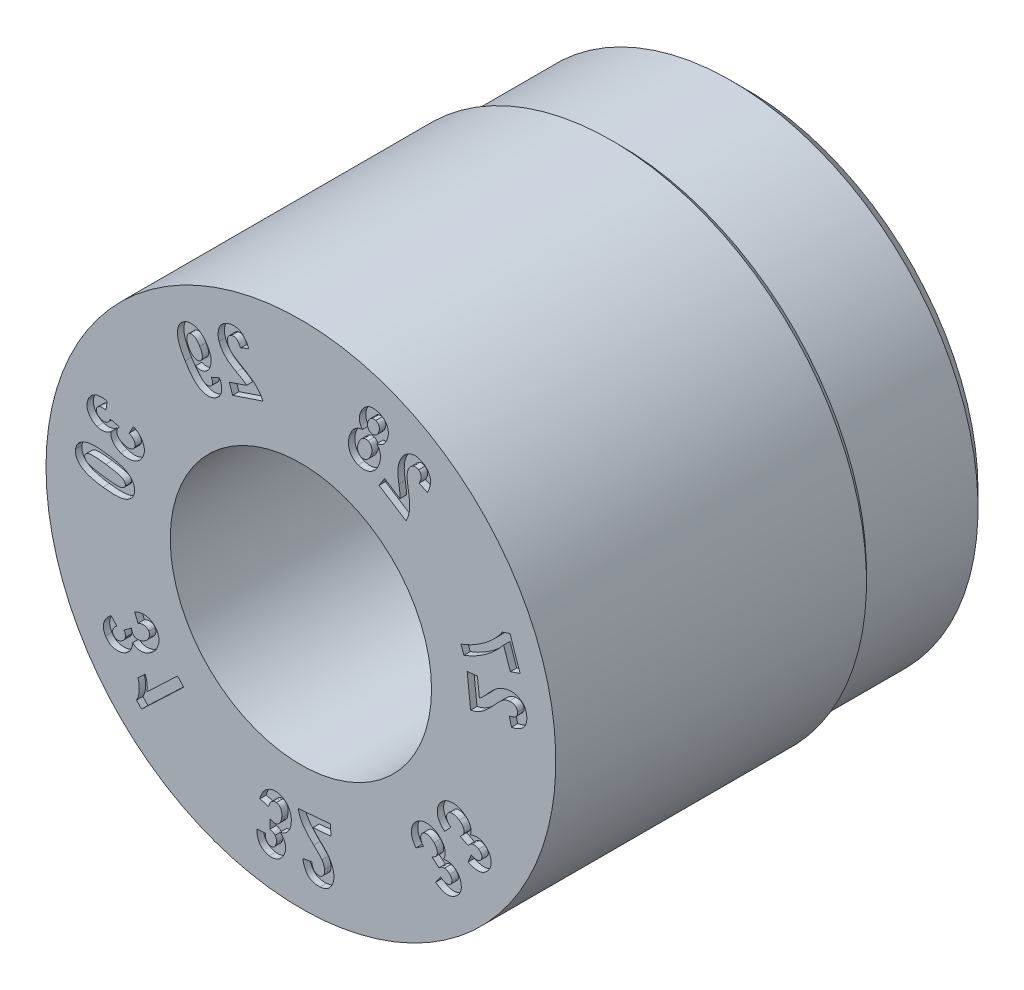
from build123d import *

# Parameters (mm, degrees)
CUT_EXTRUDE3_DEPTH = 0.2


with BuildPart() as part:
    # Sketch2 → Revolve1 (revolve)
    with BuildSketch(Plane(origin=(0, 0, 0), x_dir=(1, 0, 0), z_dir=(0, 1, 0)), mode=Mode.PRIVATE) as revolve1_sk:
        Polygon((7.249621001, 14), (2, 14), (2, 10), (4.1, 10), (4.1, 0), (8, 0), (8, 9.75), (7.75, 10), (7.75, 13.499621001), align=None)
    revolve(revolve1_sk.sketch.rotate(Axis((0, 0, -4.849143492), (0, 0, 1)), 180), axis=Axis((0, 0, -4.849143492), (0, 0, 1)))

    # Sketch9 → Cut-Extrude3 (cut)
    # profile 1 of 14: a face of its own
    with BuildSketch(Plane.XY):
        with BuildLine():
            Line((5.540256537, 1.084718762), (5.217850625, 1.0495522))
            Line((5.217850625, 1.0495522), (5.326705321, 0.051684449))
            add(Edge.make_bspline(
                [(5.326705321, 0.051684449), (5.356533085, 0.058359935), (5.416039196, 0.071677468), (5.501985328, 0.102682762), (5.585107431, 0.140552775), (5.651997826, 0.17945346), (5.705428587, 0.216492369), (5.748733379, 0.249090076), (5.794222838, 0.287380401), (5.842716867, 0.330539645), (5.893335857, 0.37951837), (5.9475489, 0.432737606), (6.003647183, 0.491990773), (6.041703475, 0.533398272), (6.061391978, 0.554820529)],
                knots=[0, 0, 0, 0, 1.210903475, 2.415741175, 3.614422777, 4.829304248, 5.477408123, 6.191639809, 6.977581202, 7.834306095, 8.765204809, 9.770030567, 10.846320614, 12, 12, 12, 12], degree=3))
            add(Edge.make_bspline(
                [(6.061391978, 0.554820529), (6.076818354, 0.571627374), (6.106260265, 0.603703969), (6.14888155, 0.648979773), (6.187412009, 0.689437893), (6.222816, 0.724303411), (6.253434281, 0.75500191), (6.280588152, 0.780453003), (6.303881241, 0.800908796), (6.318743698, 0.812216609), (6.325362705, 0.817252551)],
                knots=[0, 0, 0, 0, 1.469359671, 2.804336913, 4.005076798, 5.067497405, 6.004650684, 6.797449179, 7.46444311, 8, 8, 8, 8], degree=3))
            add(Edge.make_bspline(
                [(6.325362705, 0.817252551), (6.342361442, 0.829098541), (6.375500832, 0.852192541), (6.429082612, 0.878292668), (6.483544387, 0.896918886), (6.520811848, 0.902752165), (6.539217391, 0.905633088)],
                knots=[0, 0, 0, 0, 1.061115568, 2.068666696, 3.046158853, 4, 4, 4, 4], degree=3))
            add(Edge.make_bspline(
                [(6.539217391, 0.905633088), (6.557906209, 0.907217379), (6.593151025, 0.910205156), (6.643287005, 0.905157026), (6.687215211, 0.89337813), (6.724366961, 0.873435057), (6.754705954, 0.847415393), (6.777600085, 0.815654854), (6.79359, 0.779115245), (6.797747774, 0.752518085), (6.799884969, 0.738846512)],
                knots=[0, 0, 0, 0, 1.284830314, 2.42303217, 3.43989917, 4.386563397, 5.292301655, 6.158766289, 7.053562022, 8, 8, 8, 8], degree=3))
            add(Edge.make_bspline(
                [(6.799884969, 0.738846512), (6.800732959, 0.72385297), (6.802364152, 0.695011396), (6.793374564, 0.653092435), (6.773924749, 0.616100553), (6.745369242, 0.583611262), (6.707041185, 0.556242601), (6.659334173, 0.534348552), (6.602777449, 0.515675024), (6.561345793, 0.508062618), (6.539284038, 0.504009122)],
                knots=[0, 0, 0, 0, 0.913722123, 1.757635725, 2.579276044, 3.438933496, 4.37433614, 5.431505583, 6.632314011, 8, 8, 8, 8], degree=3))
            Line((6.539284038, 0.504009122), (6.604886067, 0.225377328))
            add(Edge.make_bspline(
                [(6.604886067, 0.225377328), (6.626895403, 0.230210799), (6.669640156, 0.239597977), (6.730913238, 0.257539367), (6.78710615, 0.278711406), (6.838601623, 0.301906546), (6.884987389, 0.328069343), (6.92651984, 0.356761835), (6.963045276, 0.388406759), (6.994653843, 0.422701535), (7.021478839, 0.459509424), (7.044222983, 0.498379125), (7.062488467, 0.539545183), (7.075900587, 0.583047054), (7.085856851, 0.62848589), (7.09067678, 0.676268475), (7.091019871, 0.726276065), (7.088181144, 0.760142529), (7.086724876, 0.777516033)],
                knots=[0, 0, 0, 0, 1.316678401, 2.557146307, 3.727226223, 4.823655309, 5.854584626, 6.835260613, 7.768888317, 8.673026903, 9.554907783, 10.425565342, 11.300463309, 12.180346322, 13.081818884, 14.014614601, 14.981496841, 16, 16, 16, 16], degree=3))
            add(Edge.make_bspline(
                [(7.086724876, 0.777516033), (7.084164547, 0.796348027), (7.079198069, 0.832877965), (7.066631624, 0.885508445), (7.049131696, 0.933716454), (7.027730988, 0.978241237), (7.001357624, 1.018176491), (6.970965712, 1.054498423), (6.935669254, 1.086129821), (6.896680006, 1.113597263), (6.855248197, 1.137231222), (6.812335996, 1.156838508), (6.768469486, 1.172660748), (6.723743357, 1.184912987), (6.677958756, 1.192819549), (6.631249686, 1.197512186), (6.583537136, 1.198007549), (6.551558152, 1.1951688), (6.535440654, 1.193738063)],
                knots=[0, 0, 0, 0, 1.173652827, 2.276629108, 3.335023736, 4.336619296, 5.321091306, 6.283820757, 7.254537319, 8.239831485, 9.225125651, 10.197062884, 11.150738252, 12.103199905, 13.057936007, 14.017536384, 15.000832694, 16, 16, 16, 16], degree=3))
            add(Edge.make_bspline(
                [(6.535440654, 1.193738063), (6.51706808, 1.191372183), (6.480494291, 1.186662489), (6.426778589, 1.174523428), (6.374207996, 1.159162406), (6.322708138, 1.140346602), (6.272114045, 1.117228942), (6.221987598, 1.090226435), (6.172064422, 1.059042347), (6.130638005, 1.029798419), (6.096863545, 1.003443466), (6.070097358, 0.980221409), (6.041581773, 0.954437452), (6.011586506, 0.92570387), (5.979791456, 0.894649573), (5.94685471, 0.860226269), (5.912056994, 0.823290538), (5.8886106, 0.797388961), (5.876576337, 0.784094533)],
                knots=[0, 0, 0, 0, 1.116805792, 2.223195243, 3.31725657, 4.418851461, 5.527133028, 6.669491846, 7.850789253, 9.075422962, 9.72636706, 10.433968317, 11.212223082, 12.045064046, 12.93920453, 13.892729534, 14.918407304, 16, 16, 16, 16], degree=3))
            add(Edge.make_bspline(
                [(5.876576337, 0.784094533), (5.86542949, 0.771793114), (5.844192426, 0.748356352), (5.813775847, 0.715079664), (5.785910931, 0.685684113), (5.761961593, 0.658848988), (5.739821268, 0.636600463), (5.721522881, 0.617052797), (5.705589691, 0.601584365), (5.681874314, 0.578671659), (5.648795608, 0.549823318), (5.617039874, 0.529188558), (5.601785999, 0.519276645)],
                knots=[0, 0, 0, 0, 1.30077431, 2.478245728, 3.532467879, 4.474445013, 5.295791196, 5.991390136, 6.572169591, 7.035389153, 8.575948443, 10, 10, 10, 10], degree=3))
            Line((5.601785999, 0.519276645), (5.540256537, 1.084718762))
        make_face()
    # profile 2 of 14: a face of its own
    with BuildSketch(Plane.XY):
        with BuildLine():
            Line((6.570787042, 1.720040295), (6.8780246, 1.824660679))
            Line((6.8780246, 1.824660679), (6.562314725, 2.752407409))
            Line((6.562314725, 2.752407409), (6.322306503, 2.670645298))
            add(Edge.make_bspline(
                [(6.322306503, 2.670645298), (6.31353488, 2.65688743), (6.295487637, 2.628581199), (6.265201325, 2.586262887), (6.231518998, 2.542613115), (6.193737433, 2.498018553), (6.153178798, 2.451534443), (6.108238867, 2.404359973), (6.060453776, 2.355122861), (5.991074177, 2.288318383), (5.899504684, 2.205308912), (5.78227565, 2.110979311), (5.658023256, 2.021985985), (5.549746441, 1.952811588), (5.461498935, 1.90029993), (5.395958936, 1.863290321), (5.331336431, 1.828935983), (5.267671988, 1.797171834), (5.205010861, 1.767871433), (5.143182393, 1.741546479), (5.082794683, 1.716880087), (5.042289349, 1.702885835), (5.022341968, 1.695994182)],
                knots=[0, 0, 0, 0, 0.59319857, 1.220480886, 1.891472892, 2.597434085, 3.345402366, 4.134310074, 4.966143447, 5.840124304, 7.636039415, 9.45836528, 11.308165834, 13.190672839, 14.128457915, 15.041954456, 15.92725675, 16.789349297, 17.628831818, 18.442016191, 19.232750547, 20, 20, 20, 20], degree=3))
            Line((5.022341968, 1.695994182), (5.111385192, 1.435024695))
            add(Edge.make_bspline(
                [(5.111385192, 1.435024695), (5.141621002, 1.446491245), (5.202151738, 1.469446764), (5.291357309, 1.508255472), (5.379854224, 1.549390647), (5.466774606, 1.594770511), (5.55281408, 1.642653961), (5.637665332, 1.693984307), (5.721232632, 1.748592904), (5.803397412, 1.806228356), (5.883339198, 1.86653951), (5.960881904, 1.928358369), (6.035226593, 1.992125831), (6.106301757, 2.057670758), (6.17475816, 2.12468254), (6.239938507, 2.193495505), (6.302111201, 2.264055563), (6.341099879, 2.312727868), (6.360554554, 2.337014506)],
                knots=[0, 0, 0, 0, 0.995131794, 1.992209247, 2.993331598, 3.998154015, 5.009292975, 6.023543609, 7.049650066, 8.081247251, 9.111904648, 10.131308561, 11.132997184, 12.125745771, 13.106564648, 14.080818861, 15.042361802, 16, 16, 16, 16], degree=3))
            Line((6.360554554, 2.337014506), (6.570787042, 1.720040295))
        make_face()
    # profile 3 of 14: a face of its own
    with BuildSketch(Plane.XY):
        with BuildLine():
            Line((2.628040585, 4.997886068), (2.452642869, 4.724070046))
            Line((2.452642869, 4.724070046), (3.300997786, 4.181012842))
            add(Edge.make_bspline(
                [(3.300997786, 4.181012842), (3.314510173, 4.20856118), (3.341413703, 4.263410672), (3.371260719, 4.350042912), (3.393773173, 4.438811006), (3.405638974, 4.515512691), (3.410782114, 4.580551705), (3.411837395, 4.634994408), (3.411171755, 4.694668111), (3.407468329, 4.759735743), (3.401589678, 4.830078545), (3.394095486, 4.906039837), (3.383068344, 4.987159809), (3.374753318, 5.043014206), (3.370463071, 5.071833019)],
                knots=[0, 0, 0, 0, 1.211637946, 2.412404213, 3.612933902, 4.827372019, 5.47430143, 6.190152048, 6.978559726, 7.832321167, 8.765076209, 9.768234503, 10.848491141, 12, 12, 12, 12], degree=3))
            add(Edge.make_bspline(
                [(3.370463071, 5.071833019), (3.367049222, 5.09440515), (3.360519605, 5.137578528), (3.351815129, 5.199243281), (3.344897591, 5.254886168), (3.339558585, 5.304433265), (3.335231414, 5.347788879), (3.332173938, 5.385043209), (3.331072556, 5.416131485), (3.331433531, 5.43487141), (3.331593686, 5.443185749)],
                knots=[0, 0, 0, 0, 1.465895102, 2.8037957, 3.998778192, 5.066181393, 6.003677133, 6.796580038, 7.466078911, 8, 8, 8, 8], degree=3))
            add(Edge.make_bspline(
                [(3.331593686, 5.443185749), (3.333246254, 5.46389316), (3.336473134, 5.504327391), (3.349217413, 5.56272422), (3.369048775, 5.61707675), (3.38807438, 5.649810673), (3.397504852, 5.666035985)],
                knots=[0, 0, 0, 0, 1.059875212, 2.069560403, 3.043133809, 4, 4, 4, 4], degree=3))
            add(Edge.make_bspline(
                [(3.397504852, 5.666035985), (3.408140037, 5.681485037), (3.428221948, 5.710656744), (3.462997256, 5.747336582), (3.500021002, 5.774058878), (3.538888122, 5.790443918), (3.578190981, 5.797389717), (3.617325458, 5.796128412), (3.655786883, 5.784919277), (3.679167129, 5.771552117), (3.691230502, 5.764655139)],
                knots=[0, 0, 0, 0, 1.283673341, 2.423899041, 3.444563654, 4.389784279, 5.287846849, 6.159174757, 7.050199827, 8, 8, 8, 8], degree=3))
            add(Edge.make_bspline(
                [(3.691230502, 5.764655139), (3.703477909, 5.755847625), (3.726990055, 5.738939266), (3.753824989, 5.705383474), (3.771025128, 5.66717927), (3.778425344, 5.624293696), (3.775608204, 5.577119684), (3.762707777, 5.526091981), (3.741625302, 5.470316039), (3.721684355, 5.433179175), (3.711059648, 5.413392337)],
                knots=[0, 0, 0, 0, 0.914998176, 1.756581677, 2.581005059, 3.440811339, 4.379414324, 5.436370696, 6.634076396, 8, 8, 8, 8], degree=3))
            Line((3.711059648, 5.413392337), (3.970265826, 5.289012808))
            add(Edge.make_bspline(
                [(3.970265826, 5.289012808), (3.980355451, 5.30929888), (3.999951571, 5.348698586), (4.024196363, 5.407920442), (4.043436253, 5.464914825), (4.057259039, 5.519745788), (4.06623068, 5.572453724), (4.069955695, 5.622992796), (4.068200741, 5.671434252), (4.061155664, 5.717754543), (4.04923661, 5.761938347), (4.033034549, 5.804213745), (4.012479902, 5.844539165), (3.986935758, 5.882614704), (3.957164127, 5.918739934), (3.922929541, 5.952702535), (3.884512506, 5.984975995), (3.856103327, 6.003823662), (3.841561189, 6.013471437)],
                knots=[0, 0, 0, 0, 1.31855266, 2.56089937, 3.721872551, 4.817576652, 5.849184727, 6.830636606, 7.762264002, 8.664941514, 9.55209577, 10.421119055, 11.296149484, 12.180985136, 13.08485663, 14.016732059, 14.984801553, 16, 16, 16, 16], degree=3))
            add(Edge.make_bspline(
                [(3.841561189, 6.013471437), (3.825236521, 6.023392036), (3.793600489, 6.042617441), (3.744457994, 6.065444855), (3.695919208, 6.082276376), (3.647704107, 6.093516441), (3.59981398, 6.098347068), (3.552297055, 6.096965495), (3.505386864, 6.089602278), (3.459439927, 6.076308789), (3.415256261, 6.058425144), (3.372699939, 6.037745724), (3.332641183, 6.013596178), (3.29516247, 5.985886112), (3.259787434, 5.955524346), (3.22736579, 5.921344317), (3.196484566, 5.884714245), (3.178585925, 5.857861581), (3.16955052, 5.844306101)],
                knots=[0, 0, 0, 0, 1.175684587, 2.278392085, 3.329300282, 4.334649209, 5.320194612, 6.284785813, 7.25428016, 8.236437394, 9.223410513, 10.186481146, 11.147580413, 12.09912404, 13.054044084, 14.014186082, 14.997542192, 16, 16, 16, 16], degree=3))
            add(Edge.make_bspline(
                [(3.16955052, 5.844306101), (3.159911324, 5.828418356), (3.14072523, 5.796794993), (3.115973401, 5.7474015), (3.094741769, 5.69673146), (3.077262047, 5.644580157), (3.063217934, 5.590589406), (3.053051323, 5.534333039), (3.045831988, 5.475688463), (3.043130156, 5.424885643), (3.042191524, 5.381799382), (3.043588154, 5.346240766), (3.045218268, 5.307738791), (3.049179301, 5.266312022), (3.053194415, 5.221868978), (3.059518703, 5.174426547), (3.066344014, 5.123977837), (3.071947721, 5.089404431), (3.074834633, 5.071592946)],
                knots=[0, 0, 0, 0, 1.11659229, 2.222493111, 3.317022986, 4.416219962, 5.52565493, 6.66710033, 7.849887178, 9.074698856, 9.723357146, 10.439414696, 11.21299271, 12.039239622, 12.940170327, 13.894945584, 14.915520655, 16, 16, 16, 16], degree=3))
            add(Edge.make_bspline(
                [(3.074834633, 5.071592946), (3.077352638, 5.055265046), (3.082174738, 5.023996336), (3.089122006, 4.979417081), (3.094865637, 4.939155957), (3.100318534, 4.903540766), (3.103820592, 4.872269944), (3.107447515, 4.845570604), (3.10953852, 4.823316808), (3.112748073, 4.79019439), (3.114015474, 4.746151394), (3.110350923, 4.708267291), (3.108598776, 4.690153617)],
                knots=[0, 0, 0, 0, 1.290215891, 2.470825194, 3.523375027, 4.466334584, 5.284205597, 5.980476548, 6.570311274, 7.029475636, 8.579691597, 10, 10, 10, 10], degree=3))
            Line((3.108598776, 4.690153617), (2.628040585, 4.997886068))
        make_face()
    # profile 4 of 14: a face of its own
    with BuildSketch(Plane.XY):
        with BuildLine():
            add(Edge.make_bspline(
                [(2.379817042, 5.819246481), (2.398751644, 5.82238114), (2.435913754, 5.828533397), (2.488744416, 5.846406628), (2.537102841, 5.871320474), (2.581035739, 5.903206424), (2.620044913, 5.942514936), (2.654448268, 5.988493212), (2.684675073, 6.041013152), (2.699854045, 6.07957603), (2.707692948, 6.099491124)],
                knots=[0, 0, 0, 0, 1.008509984, 1.979358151, 2.920007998, 3.860969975, 4.823246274, 5.822038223, 6.875231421, 8, 8, 8, 8], degree=3))
            add(Edge.make_bspline(
                [(2.707692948, 6.099491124), (2.713367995, 6.115948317), (2.724484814, 6.148186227), (2.735674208, 6.19692737), (2.743233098, 6.244307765), (2.745676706, 6.290556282), (2.74400769, 6.335618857), (2.737604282, 6.379373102), (2.726420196, 6.421682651), (2.711193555, 6.462500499), (2.691473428, 6.501283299), (2.667816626, 6.537459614), (2.640684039, 6.571122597), (2.609368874, 6.601657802), (2.574179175, 6.629269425), (2.534839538, 6.653660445), (2.492160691, 6.675766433), (2.461688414, 6.687685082), (2.446160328, 6.693758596)],
                knots=[0, 0, 0, 0, 1.13850498, 2.230211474, 3.267873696, 4.274935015, 5.255843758, 6.214599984, 7.162393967, 8.114731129, 9.060468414, 10.003456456, 10.938842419, 11.884236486, 12.859604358, 13.859972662, 14.909483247, 16, 16, 16, 16], degree=3))
            add(Edge.make_bspline(
                [(2.446160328, 6.693758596), (2.429447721, 6.699539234), (2.396852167, 6.710813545), (2.347582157, 6.721542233), (2.300123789, 6.727524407), (2.254236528, 6.728848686), (2.209939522, 6.724284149), (2.167100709, 6.715251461), (2.126054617, 6.700452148), (2.087110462, 6.680637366), (2.050130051, 6.657249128), (2.015549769, 6.630578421), (1.983988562, 6.600710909), (1.954554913, 6.568449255), (1.92873789, 6.53253663), (1.904989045, 6.494067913), (1.884057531, 6.452537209), (1.872796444, 6.423253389), (1.867078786, 6.408384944)],
                knots=[0, 0, 0, 0, 1.164214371, 2.2706339, 3.314462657, 4.312579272, 5.287592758, 6.24149712, 7.190180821, 8.152905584, 9.114775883, 10.069266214, 11.024961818, 11.974442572, 12.9417684, 13.933935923, 14.950985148, 16, 16, 16, 16], degree=3))
            add(Edge.make_bspline(
                [(1.867078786, 6.408384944), (1.860277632, 6.388062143), (1.847061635, 6.348570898), (1.836781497, 6.288318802), (1.833455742, 6.229926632), (1.839161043, 6.173585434), (1.85150093, 6.120050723), (1.870937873, 6.069974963), (1.897289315, 6.023672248), (1.919854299, 5.996443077), (1.931194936, 5.982758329)],
                knots=[0, 0, 0, 0, 1.133812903, 2.203223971, 3.227162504, 4.223308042, 5.192443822, 6.129334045, 7.059846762, 8, 8, 8, 8], degree=3))
            add(Edge.make_bspline(
                [(1.931194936, 5.982758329), (1.908434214, 5.979399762), (1.863922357, 5.972831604), (1.800524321, 5.952601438), (1.742951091, 5.92292287), (1.690535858, 5.88500153), (1.643684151, 5.83813119), (1.602231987, 5.782572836), (1.566230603, 5.718173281), (1.547604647, 5.67095381), (1.537951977, 5.646482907)],
                knots=[0, 0, 0, 0, 1.005159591, 1.965733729, 2.894762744, 3.827187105, 4.784117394, 5.781691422, 6.850389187, 8, 8, 8, 8], degree=3))
            add(Edge.make_bspline(
                [(1.537951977, 5.646482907), (1.529229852, 5.620513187), (1.512272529, 5.570023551), (1.497412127, 5.493116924), (1.490160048, 5.418394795), (1.493286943, 5.345868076), (1.504426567, 5.27702206), (1.524469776, 5.212766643), (1.551987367, 5.15327021), (1.588491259, 5.099693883), (1.631881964, 5.051935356), (1.682033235, 5.011192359), (1.737883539, 4.976284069), (1.778955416, 4.959920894), (1.799871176, 4.951587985)],
                knots=[0, 0, 0, 0, 1.182124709, 2.298255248, 3.37512457, 4.417802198, 5.424833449, 6.379172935, 7.316562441, 8.245650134, 9.168401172, 10.093707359, 11.029224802, 12, 12, 12, 12], degree=3))
            add(Edge.make_bspline(
                [(1.799871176, 4.951587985), (1.81658235, 4.946032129), (1.849393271, 4.935123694), (1.899358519, 4.924008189), (1.948920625, 4.919094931), (1.997751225, 4.918444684), (2.046112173, 4.922987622), (2.093566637, 4.933877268), (2.140784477, 4.94876038), (2.186754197, 4.969495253), (2.231190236, 4.994517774), (2.272429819, 5.025052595), (2.311207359, 5.059293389), (2.346370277, 5.098652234), (2.378627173, 5.142414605), (2.408014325, 5.190574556), (2.433833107, 5.243595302), (2.448502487, 5.280907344), (2.456025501, 5.300042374)],
                knots=[0, 0, 0, 0, 1.01183926, 1.986657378, 2.934550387, 3.869520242, 4.79019019, 5.718604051, 6.662898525, 7.631249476, 8.611803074, 9.588288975, 10.574950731, 11.580336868, 12.615364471, 13.696133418, 14.818489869, 16, 16, 16, 16], degree=3))
            add(Edge.make_bspline(
                [(2.456025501, 5.300042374), (2.464237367, 5.325113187), (2.4801735, 5.373766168), (2.494565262, 5.447261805), (2.498810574, 5.518267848), (2.493506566, 5.586364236), (2.479022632, 5.651205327), (2.455221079, 5.712079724), (2.422270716, 5.768844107), (2.394085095, 5.802306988), (2.379817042, 5.819246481)],
                knots=[0, 0, 0, 0, 1.142986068, 2.218104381, 3.236416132, 4.21764753, 5.169796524, 6.106016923, 7.041232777, 8, 8, 8, 8], degree=3))
        make_face()
        with BuildLine():
            add(Edge.make_bspline(
                [(2.444987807, 6.169117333), (2.438770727, 6.153455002), (2.426995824, 6.123791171), (2.402852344, 6.08484324), (2.374778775, 6.053863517), (2.343155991, 6.03103068), (2.309116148, 6.016660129), (2.273859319, 6.010043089), (2.237688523, 6.011181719), (2.214544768, 6.018288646), (2.202764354, 6.021906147)],
                knots=[0, 0, 0, 0, 1.266211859, 2.398154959, 3.42749254, 4.393652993, 5.309282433, 6.184661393, 7.075973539, 8, 8, 8, 8], degree=3))
            add(Edge.make_bspline(
                [(2.202764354, 6.021906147), (2.191281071, 6.026825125), (2.168775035, 6.036465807), (2.13994292, 6.058973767), (2.116834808, 6.086838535), (2.099648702, 6.119844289), (2.089490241, 6.15776602), (2.087849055, 6.199674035), (2.094193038, 6.24506176), (2.104060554, 6.275348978), (2.109276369, 6.291358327)],
                knots=[0, 0, 0, 0, 0.931819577, 1.826269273, 2.706368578, 3.623450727, 4.58957414, 5.619652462, 6.741785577, 8, 8, 8, 8], degree=3))
            add(Edge.make_bspline(
                [(2.109276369, 6.291358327), (2.115395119, 6.306471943), (2.126976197, 6.33507778), (2.150487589, 6.372900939), (2.178364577, 6.40295668), (2.210045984, 6.42514764), (2.243986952, 6.439309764), (2.278874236, 6.446938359), (2.314696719, 6.44493125), (2.337526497, 6.438164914), (2.349215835, 6.434700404)],
                knots=[0, 0, 0, 0, 1.245516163, 2.35741281, 3.385283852, 4.360576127, 5.291212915, 6.182333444, 7.069315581, 8, 8, 8, 8], degree=3))
            add(Edge.make_bspline(
                [(2.349215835, 6.434700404), (2.360948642, 6.429705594), (2.383710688, 6.420015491), (2.413326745, 6.397790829), (2.436205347, 6.369264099), (2.4532901, 6.336108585), (2.463518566, 6.298506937), (2.465413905, 6.257599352), (2.459451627, 6.213645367), (2.449984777, 6.184500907), (2.444987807, 6.169117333)],
                knots=[0, 0, 0, 0, 0.961554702, 1.865449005, 2.765262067, 3.703753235, 4.666657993, 5.687156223, 6.779191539, 8, 8, 8, 8], degree=3))
        make_face(mode=Mode.SUBTRACT)
        with BuildLine():
            add(Edge.make_bspline(
                [(2.202898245, 5.42817426), (2.198800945, 5.417063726), (2.190827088, 5.395441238), (2.176110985, 5.365080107), (2.160966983, 5.336968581), (2.144527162, 5.311589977), (2.127037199, 5.288832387), (2.108265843, 5.268955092), (2.088793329, 5.251085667), (2.061478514, 5.232328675), (2.026670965, 5.214489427), (1.983719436, 5.203001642), (1.940669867, 5.20155219), (1.913763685, 5.209545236), (1.900231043, 5.213565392)],
                knots=[0, 0, 0, 0, 1.030413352, 2.005313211, 2.934416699, 3.809195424, 4.6351356, 5.429452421, 6.187355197, 6.930950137, 8.308791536, 9.569737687, 10.777683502, 12, 12, 12, 12], degree=3))
            add(Edge.make_bspline(
                [(1.900231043, 5.213565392), (1.887343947, 5.219081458), (1.86182697, 5.230003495), (1.830105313, 5.257891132), (1.805114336, 5.292966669), (1.790509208, 5.327526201), (1.782164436, 5.35819156), (1.778851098, 5.383598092), (1.777735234, 5.410553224), (1.779744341, 5.439074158), (1.783538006, 5.469178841), (1.790516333, 5.500774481), (1.799517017, 5.534012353), (1.807370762, 5.556355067), (1.811405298, 5.56783271)],
                knots=[0, 0, 0, 0, 1.227835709, 2.43116492, 3.66162978, 4.99481825, 5.710610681, 6.455131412, 7.245586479, 8.082473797, 8.96959714, 9.915259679, 10.929051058, 12, 12, 12, 12], degree=3))
            add(Edge.make_bspline(
                [(1.811405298, 5.56783271), (1.819059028, 5.587079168), (1.833619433, 5.6236935), (1.863384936, 5.672176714), (1.897974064, 5.711649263), (1.937092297, 5.741385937), (1.978235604, 5.762185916), (2.020573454, 5.772811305), (2.06332932, 5.773147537), (2.090249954, 5.76515207), (2.1038747, 5.761105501)],
                knots=[0, 0, 0, 0, 1.269538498, 2.415161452, 3.473523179, 4.472658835, 5.413331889, 6.283921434, 7.13147903, 8, 8, 8, 8], degree=3))
            add(Edge.make_bspline(
                [(2.1038747, 5.761105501), (2.116860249, 5.755513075), (2.142463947, 5.744486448), (2.17434415, 5.716448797), (2.199699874, 5.681119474), (2.2174948, 5.63864028), (2.228628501, 5.590915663), (2.228827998, 5.539054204), (2.221517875, 5.483829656), (2.209297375, 5.447301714), (2.202898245, 5.42817426)],
                knots=[0, 0, 0, 0, 0.872593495, 1.720498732, 2.594929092, 3.551417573, 4.559725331, 5.615300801, 6.751278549, 8, 8, 8, 8], degree=3))
        make_face(mode=Mode.SUBTRACT)
    # profile 5 of 14: a face of its own
    with BuildSketch(Plane.XY):
        with BuildLine():
            Line((-2.248228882, 5.179094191), (-2.144880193, 4.871801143))
            Line((-2.144880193, 4.871801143), (-1.193730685, 5.191538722))
            add(Edge.make_bspline(
                [(-1.193730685, 5.191538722), (-1.206745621, 5.219246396), (-1.23265436, 5.274403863), (-1.280916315, 5.351994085), (-1.335684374, 5.425118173), (-1.388060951, 5.482152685), (-1.43537799, 5.526839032), (-1.47695342, 5.561534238), (-1.523671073, 5.598291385), (-1.576733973, 5.63561851), (-1.63456188, 5.675853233), (-1.698730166, 5.716385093), (-1.768081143, 5.759086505), (-1.816630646, 5.787251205), (-1.841746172, 5.801821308)],
                knots=[0, 0, 0, 0, 1.213344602, 2.415396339, 3.616614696, 4.832785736, 5.481411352, 6.196944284, 6.979833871, 7.83856891, 8.769679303, 9.77383743, 10.848366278, 12, 12, 12, 12], degree=3))
            add(Edge.make_bspline(
                [(-1.841746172, 5.801821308), (-1.86145663, 5.813269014), (-1.899077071, 5.835118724), (-1.952448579, 5.866941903), (-2.000119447, 5.896133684), (-2.042154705, 5.922604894), (-2.078243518, 5.946676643), (-2.109221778, 5.967262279), (-2.134006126, 5.985790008), (-2.148168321, 5.997817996), (-2.154428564, 6.003134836)],
                knots=[0, 0, 0, 0, 1.469432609, 2.804638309, 4.005771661, 5.073045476, 6.006764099, 6.802333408, 7.470584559, 8, 8, 8, 8], degree=3))
            add(Edge.make_bspline(
                [(-2.154428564, 6.003134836), (-2.169706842, 6.01727371), (-2.199466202, 6.044813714), (-2.236472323, 6.091574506), (-2.266562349, 6.14070471), (-2.280048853, 6.175924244), (-2.286745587, 6.193412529)],
                knots=[0, 0, 0, 0, 1.064219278, 2.072909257, 3.04310172, 4, 4, 4, 4], degree=3))
            add(Edge.make_bspline(
                [(-2.286745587, 6.193412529), (-2.29222432, 6.211351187), (-2.302546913, 6.245149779), (-2.308484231, 6.295156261), (-2.306860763, 6.34064395), (-2.295079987, 6.381123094), (-2.275808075, 6.415856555), (-2.250466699, 6.445484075), (-2.217958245, 6.468647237), (-2.192883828, 6.478447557), (-2.180000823, 6.483482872)],
                knots=[0, 0, 0, 0, 1.286477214, 2.423877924, 3.44414983, 4.393245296, 5.290766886, 6.155108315, 7.052111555, 8, 8, 8, 8], degree=3))
            add(Edge.make_bspline(
                [(-2.180000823, 6.483482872), (-2.165515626, 6.487601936), (-2.13763121, 6.495531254), (-2.094721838, 6.494718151), (-2.054241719, 6.484541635), (-2.016471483, 6.463156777), (-1.981786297, 6.431477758), (-1.949959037, 6.389652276), (-1.919984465, 6.338407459), (-1.903753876, 6.299671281), (-1.895148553, 6.279133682)],
                knots=[0, 0, 0, 0, 0.915446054, 1.762259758, 2.586675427, 3.441795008, 4.384146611, 5.436996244, 6.641116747, 8, 8, 8, 8], degree=3))
            Line((-1.895148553, 6.279133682), (-1.636719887, 6.402892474))
            add(Edge.make_bspline(
                [(-1.636719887, 6.402892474), (-1.646281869, 6.423398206), (-1.664792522, 6.463094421), (-1.695089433, 6.519295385), (-1.727234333, 6.569911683), (-1.761445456, 6.614779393), (-1.79644116, 6.654843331), (-1.833622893, 6.689059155), (-1.872256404, 6.718055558), (-1.912477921, 6.741778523), (-1.954467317, 6.759744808), (-1.997354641, 6.773750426), (-2.041668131, 6.782720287), (-2.086965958, 6.786737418), (-2.133586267, 6.786147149), (-2.181245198, 6.780751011), (-2.230303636, 6.770821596), (-2.262653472, 6.760638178), (-2.279237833, 6.75541758)],
                knots=[0, 0, 0, 0, 1.321590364, 2.558413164, 3.727230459, 4.820384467, 5.851850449, 6.830887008, 7.766402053, 8.669252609, 9.551502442, 10.429373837, 11.300769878, 12.186559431, 13.081238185, 14.019844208, 14.984859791, 16, 16, 16, 16], degree=3))
            add(Edge.make_bspline(
                [(-2.279237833, 6.75541758), (-2.297083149, 6.748944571), (-2.331800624, 6.736351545), (-2.380272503, 6.712638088), (-2.423764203, 6.685361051), (-2.462336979, 6.654818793), (-2.496241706, 6.620830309), (-2.524846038, 6.583229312), (-2.548709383, 6.542269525), (-2.566781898, 6.498189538), (-2.580380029, 6.45259707), (-2.590813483, 6.406637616), (-2.597216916, 6.360496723), (-2.599253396, 6.314130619), (-2.597421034, 6.267594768), (-2.591725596, 6.220833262), (-2.581757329, 6.174013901), (-2.572287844, 6.143304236), (-2.567509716, 6.127808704)],
                knots=[0, 0, 0, 0, 1.172031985, 2.280149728, 3.325978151, 4.337656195, 5.313101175, 6.28355329, 7.248177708, 8.232945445, 9.218652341, 10.184564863, 11.14172639, 12.092036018, 13.047716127, 14.015512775, 14.998664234, 16, 16, 16, 16], degree=3))
            add(Edge.make_bspline(
                [(-2.567509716, 6.127808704), (-2.561283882, 6.11037713), (-2.548906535, 6.075722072), (-2.525538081, 6.025771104), (-2.499420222, 5.977639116), (-2.469455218, 5.931557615), (-2.436164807, 5.887132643), (-2.399158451, 5.843794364), (-2.35785612, 5.801954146), (-2.320478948, 5.767747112), (-2.287489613, 5.740515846), (-2.259464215, 5.718916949), (-2.228169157, 5.696640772), (-2.193780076, 5.673463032), (-2.156482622, 5.6493667), (-2.115997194, 5.624367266), (-2.072676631, 5.597997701), (-2.04229216, 5.58084561), (-2.026680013, 5.572032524)],
                knots=[0, 0, 0, 0, 1.116552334, 2.219775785, 3.324099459, 4.419313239, 5.533787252, 6.672490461, 7.855744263, 9.079813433, 9.728580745, 10.436896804, 11.214743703, 12.046467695, 12.939573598, 13.894393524, 14.918097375, 16, 16, 16, 16], degree=3))
            add(Edge.make_bspline(
                [(-2.026680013, 5.572032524), (-2.012343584, 5.563757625), (-1.984958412, 5.547951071), (-1.946062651, 5.52515249), (-1.910972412, 5.504995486), (-1.88035, 5.486268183), (-1.853268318, 5.470401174), (-1.830362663, 5.45629869), (-1.811921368, 5.443793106), (-1.784151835, 5.426025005), (-1.749550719, 5.399172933), (-1.722388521, 5.372921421), (-1.709360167, 5.360329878)],
                knots=[0, 0, 0, 0, 1.297730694, 2.478900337, 3.534603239, 4.470131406, 5.29275881, 5.995383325, 6.578388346, 7.039332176, 8.579915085, 10, 10, 10, 10], degree=3))
            Line((-1.709360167, 5.360329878), (-2.248228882, 5.179094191))
        make_face()
    # profile 6 of 14: a face of its own
    with BuildSketch(Plane.XY):
        with BuildLine():
            Line((-2.552197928, 5.144106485), (-2.808130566, 5.032473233))
            add(Edge.make_bspline(
                [(-2.808130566, 5.032473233), (-2.801559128, 5.017957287), (-2.789094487, 4.990423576), (-2.776667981, 4.949433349), (-2.770513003, 4.911744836), (-2.771346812, 4.87742235), (-2.778177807, 4.846079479), (-2.792942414, 4.818635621), (-2.813565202, 4.794096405), (-2.83164709, 4.782106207), (-2.841052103, 4.775869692)],
                knots=[0, 0, 0, 0, 1.326043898, 2.515227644, 3.557093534, 4.492615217, 5.36056764, 6.201385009, 7.064478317, 8, 8, 8, 8], degree=3))
            add(Edge.make_bspline(
                [(-2.841052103, 4.775869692), (-2.847833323, 4.772005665), (-2.861288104, 4.764338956), (-2.88328578, 4.757241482), (-2.905770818, 4.752805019), (-2.92890082, 4.752004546), (-2.952756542, 4.754403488), (-2.977352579, 4.759709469), (-3.002518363, 4.768921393), (-3.028803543, 4.7813619), (-3.056734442, 4.798418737), (-3.08586829, 4.822262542), (-3.117445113, 4.85179909), (-3.151342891, 4.887592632), (-3.187071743, 4.929875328), (-3.22515186, 4.978344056), (-3.265743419, 5.032729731), (-3.292706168, 5.071659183), (-3.306751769, 5.091938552)],
                knots=[0, 0, 0, 0, 0.606244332, 1.202863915, 1.789700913, 2.38655146, 2.997100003, 3.652853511, 4.340145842, 5.078794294, 5.914719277, 6.881008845, 8.004198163, 9.280374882, 10.716834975, 12.312996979, 14.079343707, 16, 16, 16, 16], degree=3))
            add(Edge.make_bspline(
                [(-3.306751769, 5.091938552), (-3.292850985, 5.086292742), (-3.265766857, 5.075292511), (-3.224533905, 5.063701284), (-3.184126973, 5.057197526), (-3.144697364, 5.055786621), (-3.106156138, 5.05922073), (-3.068473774, 5.067604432), (-3.031815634, 5.081654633), (-3.008723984, 5.094383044), (-2.997020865, 5.100833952)],
                knots=[0, 0, 0, 0, 1.114201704, 2.170897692, 3.174639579, 4.148381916, 5.094802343, 6.042327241, 7.007828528, 8, 8, 8, 8], degree=3))
            add(Edge.make_bspline(
                [(-2.997020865, 5.100833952), (-2.985241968, 5.108517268), (-2.961896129, 5.123745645), (-2.931121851, 5.152003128), (-2.903575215, 5.183274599), (-2.880399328, 5.218795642), (-2.859801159, 5.257514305), (-2.844003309, 5.300496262), (-2.831637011, 5.346957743), (-2.822541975, 5.396368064), (-2.818432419, 5.448189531), (-2.819011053, 5.501264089), (-2.825260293, 5.555158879), (-2.837005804, 5.609661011), (-2.853778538, 5.664817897), (-2.87585, 5.720637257), (-2.902786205, 5.777345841), (-2.92428692, 5.814388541), (-2.93527813, 5.833324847)],
                knots=[0, 0, 0, 0, 0.827255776, 1.639625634, 2.452351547, 3.276517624, 4.132339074, 5.031033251, 5.967168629, 6.962722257, 7.986487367, 9.024919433, 10.085033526, 11.17709246, 12.305398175, 13.477560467, 14.710523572, 16, 16, 16, 16], degree=3))
            add(Edge.make_bspline(
                [(-2.93527813, 5.833324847), (-2.947700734, 5.853066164), (-2.971975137, 5.891641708), (-3.011983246, 5.944947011), (-3.053585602, 5.992900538), (-3.096942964, 6.035272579), (-3.141990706, 6.072302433), (-3.18870243, 6.104107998), (-3.237378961, 6.129903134), (-3.287228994, 6.150200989), (-3.337503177, 6.164773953), (-3.387173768, 6.174136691), (-3.43600836, 6.178516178), (-3.483788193, 6.176453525), (-3.530793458, 6.169894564), (-3.576450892, 6.156397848), (-3.621653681, 6.138966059), (-3.649938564, 6.122755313), (-3.664267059, 6.114543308)],
                knots=[0, 0, 0, 0, 1.280011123, 2.501207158, 3.654545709, 4.762088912, 5.825065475, 6.851983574, 7.858961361, 8.843441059, 9.801684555, 10.727345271, 11.61474167, 12.486508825, 13.347575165, 14.212847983, 15.094668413, 16, 16, 16, 16], degree=3))
            add(Edge.make_bspline(
                [(-3.664267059, 6.114543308), (-3.679780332, 6.10442038), (-3.710285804, 6.084514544), (-3.75062738, 6.048174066), (-3.785199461, 6.007522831), (-3.814755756, 5.962751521), (-3.837919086, 5.913062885), (-3.855438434, 5.859091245), (-3.867849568, 5.80093064), (-3.87395076, 5.738299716), (-3.873699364, 5.670776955), (-3.8642245, 5.598212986), (-3.846515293, 5.520681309), (-3.820358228, 5.438122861), (-3.785802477, 5.350522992), (-3.742847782, 5.257859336), (-3.691612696, 5.160027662), (-3.652758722, 5.094316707), (-3.632591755, 5.060209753)],
                knots=[0, 0, 0, 0, 0.753922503, 1.482521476, 2.202906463, 2.923658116, 3.661659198, 4.429422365, 5.231471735, 6.080061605, 6.988887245, 7.97681889, 9.055216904, 10.22573234, 11.502195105, 12.889817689, 14.385674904, 16, 16, 16, 16], degree=3))
            add(Edge.make_bspline(
                [(-3.632591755, 5.060209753), (-3.611270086, 5.025919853), (-3.57014494, 4.959781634), (-3.505801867, 4.867347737), (-3.442439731, 4.78462142), (-3.379336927, 4.71198488), (-3.316359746, 4.649628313), (-3.253979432, 4.597063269), (-3.19217044, 4.554004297), (-3.130128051, 4.521806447), (-3.069225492, 4.497755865), (-3.009394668, 4.481493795), (-2.950798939, 4.47235247), (-2.893221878, 4.471102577), (-2.836765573, 4.476456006), (-2.781389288, 4.489796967), (-2.727180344, 4.510451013), (-2.693163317, 4.529674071), (-2.675871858, 4.539445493)],
                knots=[0, 0, 0, 0, 1.588598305, 3.064081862, 4.429542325, 5.687119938, 6.847065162, 7.91312116, 8.893682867, 9.804356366, 10.657039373, 11.465640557, 12.239242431, 12.984464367, 13.726088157, 14.464302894, 15.219377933, 16, 16, 16, 16], degree=3))
            add(Edge.make_bspline(
                [(-2.675871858, 4.539445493), (-2.664225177, 4.54682266), (-2.641343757, 4.561316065), (-2.610416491, 4.586664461), (-2.582317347, 4.613395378), (-2.557931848, 4.642445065), (-2.537115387, 4.673611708), (-2.519279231, 4.706611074), (-2.505270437, 4.7418374), (-2.494076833, 4.778822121), (-2.487242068, 4.817940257), (-2.484033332, 4.859010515), (-2.485829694, 4.901980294), (-2.490642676, 4.946970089), (-2.500152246, 4.993722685), (-2.513103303, 5.042495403), (-2.530729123, 5.092919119), (-2.544899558, 5.126705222), (-2.552197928, 5.144106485)],
                knots=[0, 0, 0, 0, 0.966019, 1.897869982, 2.798813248, 3.682802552, 4.551353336, 5.42337277, 6.308204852, 7.205583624, 8.12851332, 9.087562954, 10.088817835, 11.14000695, 12.257761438, 13.430892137, 14.676801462, 16, 16, 16, 16], degree=3))
        make_face()
        with BuildLine():
            add(Edge.make_bspline(
                [(-3.500745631, 5.460545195), (-3.507772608, 5.472540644), (-3.52139838, 5.495800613), (-3.5389021, 5.531009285), (-3.553784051, 5.564881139), (-3.565580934, 5.597867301), (-3.574163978, 5.629749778), (-3.580209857, 5.660521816), (-3.582549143, 5.690261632), (-3.582218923, 5.718730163), (-3.579467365, 5.745495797), (-3.574549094, 5.770292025), (-3.567712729, 5.792955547), (-3.55923108, 5.813685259), (-3.548318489, 5.831935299), (-3.535807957, 5.848183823), (-3.520926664, 5.861993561), (-3.50976124, 5.869480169), (-3.504131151, 5.873255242)],
                knots=[0, 0, 0, 0, 1.467010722, 2.844630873, 4.147480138, 5.370376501, 6.538184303, 7.62999836, 8.675438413, 9.680782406, 10.631485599, 11.511446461, 12.344793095, 13.127141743, 13.8688308, 14.582442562, 15.285206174, 16, 16, 16, 16], degree=3))
            add(Edge.make_bspline(
                [(-3.504131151, 5.873255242), (-3.492770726, 5.879099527), (-3.470163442, 5.890729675), (-3.431476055, 5.896492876), (-3.39133286, 5.89160043), (-3.357302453, 5.880352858), (-3.32976628, 5.86593165), (-3.30822945, 5.85121599), (-3.286771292, 5.832647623), (-3.264891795, 5.810797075), (-3.243007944, 5.785264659), (-3.22066103, 5.756599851), (-3.19812457, 5.724183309), (-3.183769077, 5.700980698), (-3.176280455, 5.688876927)],
                knots=[0, 0, 0, 0, 1.09113966, 2.171371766, 3.296040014, 4.538463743, 5.225494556, 5.959689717, 6.772526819, 7.658429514, 8.612341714, 9.657674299, 10.778112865, 12, 12, 12, 12], degree=3))
            add(Edge.make_bspline(
                [(-3.176280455, 5.688876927), (-3.169116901, 5.676645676), (-3.155254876, 5.652977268), (-3.137085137, 5.617560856), (-3.121685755, 5.583857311), (-3.109645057, 5.55159636), (-3.100528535, 5.520978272), (-3.094240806, 5.491952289), (-3.091385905, 5.464415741), (-3.091534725, 5.43093972), (-3.097695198, 5.392603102), (-3.113373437, 5.352013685), (-3.137504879, 5.3177302), (-3.159696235, 5.302167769), (-3.17091271, 5.294301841)],
                knots=[0, 0, 0, 0, 1.162412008, 2.249356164, 3.263363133, 4.20001548, 5.071192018, 5.88180667, 6.632338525, 7.336834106, 8.623629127, 9.791117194, 10.883534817, 12, 12, 12, 12], degree=3))
            add(Edge.make_bspline(
                [(-3.17091271, 5.294301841), (-3.182606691, 5.28835082), (-3.205879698, 5.276507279), (-3.245793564, 5.270433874), (-3.287722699, 5.274982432), (-3.323445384, 5.286292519), (-3.352491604, 5.300453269), (-3.374817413, 5.314154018), (-3.396702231, 5.331241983), (-3.418099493, 5.351256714), (-3.43939854, 5.374206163), (-3.460190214, 5.400230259), (-3.481164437, 5.429028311), (-3.494079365, 5.449815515), (-3.500745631, 5.460545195)],
                knots=[0, 0, 0, 0, 1.144935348, 2.278615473, 3.479603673, 4.818077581, 5.541795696, 6.31027792, 7.110855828, 7.972585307, 8.877534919, 9.854345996, 10.892483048, 12, 12, 12, 12], degree=3))
        make_face(mode=Mode.SUBTRACT)
    # profile 7 of 14: a face of its own
    with BuildSketch(Plane.XY):
        with BuildLine():
            Line((-5.256051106, 2.466283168), (-5.39009792, 2.220512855))
            add(Edge.make_bspline(
                [(-5.39009792, 2.220512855), (-5.371854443, 2.211326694), (-5.337147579, 2.193850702), (-5.291648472, 2.161723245), (-5.25509581, 2.12644009), (-5.228819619, 2.08775754), (-5.211089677, 2.048121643), (-5.202373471, 2.008156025), (-5.202425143, 1.968285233), (-5.210013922, 1.943305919), (-5.213823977, 1.930764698)],
                knots=[0, 0, 0, 0, 1.309740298, 2.49168391, 3.561442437, 4.552566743, 5.475027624, 6.331709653, 7.162410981, 8, 8, 8, 8], degree=3))
            add(Edge.make_bspline(
                [(-5.213823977, 1.930764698), (-5.21956806, 1.91770959), (-5.230996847, 1.891734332), (-5.260137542, 1.859715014), (-5.296934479, 1.834308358), (-5.333434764, 1.820163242), (-5.365590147, 1.811963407), (-5.391657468, 1.808340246), (-5.418999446, 1.807387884), (-5.447447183, 1.808266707), (-5.476942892, 1.812601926), (-5.50758284, 1.81869526), (-5.539411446, 1.827442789), (-5.560726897, 1.834838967), (-5.571635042, 1.838623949)],
                knots=[0, 0, 0, 0, 1.240824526, 2.468822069, 3.728020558, 5.125042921, 5.866236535, 6.62917788, 7.421798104, 8.257794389, 9.115230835, 10.026383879, 10.990005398, 12, 12, 12, 12], degree=3))
            add(Edge.make_bspline(
                [(-5.571635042, 1.838623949), (-5.591047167, 1.846552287), (-5.62802795, 1.861656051), (-5.677616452, 1.89091926), (-5.717408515, 1.925640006), (-5.747857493, 1.963938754), (-5.768484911, 2.004231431), (-5.780200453, 2.044885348), (-5.780640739, 2.085876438), (-5.773308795, 2.111565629), (-5.769607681, 2.124533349)],
                knots=[0, 0, 0, 0, 1.30061019, 2.477708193, 3.555253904, 4.560816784, 5.496006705, 6.348048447, 7.16610657, 8, 8, 8, 8], degree=3))
            add(Edge.make_bspline(
                [(-5.769607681, 2.124533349), (-5.766079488, 2.133412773), (-5.758613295, 2.152202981), (-5.742154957, 2.17956372), (-5.722875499, 2.208925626), (-5.70760688, 2.228067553), (-5.6996085, 2.238094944)],
                knots=[0, 0, 0, 0, 0.854502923, 1.808258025, 2.851868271, 4, 4, 4, 4], degree=3))
            Line((-5.6996085, 2.238094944), (-5.977366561, 2.307219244))
            add(Edge.make_bspline(
                [(-5.977366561, 2.307219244), (-5.983691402, 2.290827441), (-5.995792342, 2.259465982), (-6.022671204, 2.218753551), (-6.054923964, 2.185525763), (-6.080961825, 2.170794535), (-6.093931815, 2.16345661)],
                knots=[0, 0, 0, 0, 1.107165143, 2.118273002, 3.06267339, 4, 4, 4, 4], degree=3))
            add(Edge.make_bspline(
                [(-6.093931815, 2.16345661), (-6.107616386, 2.158121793), (-6.135392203, 2.147293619), (-6.181646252, 2.142805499), (-6.230798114, 2.148425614), (-6.26327238, 2.158953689), (-6.280286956, 2.164469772)],
                knots=[0, 0, 0, 0, 0.917800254, 1.862875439, 2.88027437, 4, 4, 4, 4], degree=3))
            add(Edge.make_bspline(
                [(-6.280286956, 2.164469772), (-6.294079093, 2.170123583), (-6.320312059, 2.180877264), (-6.354871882, 2.202856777), (-6.383091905, 2.228223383), (-6.403645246, 2.257703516), (-6.417426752, 2.289054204), (-6.423547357, 2.32186156), (-6.422417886, 2.355459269), (-6.4158418, 2.377024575), (-6.412473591, 2.388070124)],
                knots=[0, 0, 0, 0, 1.224768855, 2.329539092, 3.353683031, 4.326839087, 5.264810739, 6.150949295, 7.05293351, 8, 8, 8, 8], degree=3))
            add(Edge.make_bspline(
                [(-6.412473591, 2.388070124), (-6.407833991, 2.398861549), (-6.398644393, 2.42023599), (-6.374957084, 2.446730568), (-6.346317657, 2.469255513), (-6.31085079, 2.485396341), (-6.269930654, 2.496027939), (-6.223655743, 2.497905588), (-6.172428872, 2.493372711), (-6.137564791, 2.48447295), (-6.119074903, 2.479753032)],
                knots=[0, 0, 0, 0, 0.826285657, 1.636613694, 2.48251286, 3.391112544, 4.372615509, 5.457260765, 6.651478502, 8, 8, 8, 8], degree=3))
            Line((-6.119074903, 2.479753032), (-6.078956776, 2.746797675))
            add(Edge.make_bspline(
                [(-6.078956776, 2.746797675), (-6.099190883, 2.750370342), (-6.138292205, 2.75727433), (-6.195838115, 2.763700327), (-6.25021386, 2.766723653), (-6.301520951, 2.765085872), (-6.349573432, 2.760357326), (-6.39452848, 2.752060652), (-6.436128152, 2.739013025), (-6.474951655, 2.723049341), (-6.510451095, 2.702727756), (-6.543586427, 2.6800394), (-6.573985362, 2.654059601), (-6.601599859, 2.625069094), (-6.626351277, 2.592885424), (-6.648815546, 2.557947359), (-6.668692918, 2.519922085), (-6.679277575, 2.492873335), (-6.684657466, 2.479125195)],
                knots=[0, 0, 0, 0, 1.346084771, 2.601236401, 3.791977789, 4.91142699, 5.961221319, 6.953956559, 7.900554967, 8.81327527, 9.698893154, 10.575501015, 11.441503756, 12.314056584, 13.194257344, 14.097805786, 15.033166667, 16, 16, 16, 16], degree=3))
            add(Edge.make_bspline(
                [(-6.684657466, 2.479125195), (-6.690045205, 2.463455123), (-6.70059748, 2.432764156), (-6.709900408, 2.38591089), (-6.71498265, 2.340014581), (-6.714449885, 2.29503338), (-6.708968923, 2.250844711), (-6.697538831, 2.2079215), (-6.682080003, 2.16544446), (-6.660370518, 2.124983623), (-6.635718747, 2.086259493), (-6.60879952, 2.049945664), (-6.579226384, 2.017157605), (-6.547875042, 1.987273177), (-6.513898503, 1.961028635), (-6.478103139, 1.937617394), (-6.439718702, 1.917707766), (-6.412896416, 1.906986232), (-6.399334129, 1.901565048)],
                knots=[0, 0, 0, 0, 1.106852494, 2.167850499, 3.186190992, 4.189785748, 5.168772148, 6.155377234, 7.15399705, 8.184278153, 9.21797362, 10.222445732, 11.202677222, 12.167053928, 13.114595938, 14.069262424, 15.023751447, 16, 16, 16, 16], degree=3))
            add(Edge.make_bspline(
                [(-6.399334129, 1.901565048), (-6.380848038, 1.895399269), (-6.344694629, 1.883340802), (-6.288868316, 1.873981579), (-6.233647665, 1.871683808), (-6.178779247, 1.877069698), (-6.124238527, 1.889118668), (-6.070600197, 1.909801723), (-6.016913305, 1.936755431), (-5.983225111, 1.960036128), (-5.965899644, 1.972009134)],
                knots=[0, 0, 0, 0, 1.017893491, 1.990703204, 2.949001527, 3.900614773, 4.866389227, 5.860714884, 6.89978926, 8, 8, 8, 8], degree=3))
            add(Edge.make_bspline(
                [(-5.965899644, 1.972009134), (-5.966643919, 1.961315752), (-5.968120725, 1.940097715), (-5.966689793, 1.908366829), (-5.962884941, 1.877042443), (-5.955011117, 1.846487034), (-5.94558179, 1.816151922), (-5.932307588, 1.786593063), (-5.916856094, 1.757294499), (-5.898031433, 1.728944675), (-5.87727455, 1.70112746), (-5.852897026, 1.675492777), (-5.826601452, 1.650995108), (-5.79772701, 1.628266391), (-5.765989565, 1.607943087), (-5.732202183, 1.588768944), (-5.69576748, 1.57141818), (-5.670232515, 1.561485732), (-5.657168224, 1.556404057)],
                knots=[0, 0, 0, 0, 0.92035871, 1.826195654, 2.724901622, 3.626280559, 4.533413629, 5.451215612, 6.405888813, 7.376544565, 8.372463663, 9.38410085, 10.411052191, 11.459142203, 12.53634771, 13.646245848, 14.795763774, 16, 16, 16, 16], degree=3))
            add(Edge.make_bspline(
                [(-5.657168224, 1.556404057), (-5.637895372, 1.549782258), (-5.60007794, 1.536788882), (-5.542611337, 1.523030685), (-5.486091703, 1.514589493), (-5.430406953, 1.511772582), (-5.375752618, 1.51362736), (-5.321961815, 1.521002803), (-5.269338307, 1.534466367), (-5.21806284, 1.552279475), (-5.169284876, 1.57436397), (-5.124170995, 1.600250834), (-5.083443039, 1.629846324), (-5.046647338, 1.662691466), (-5.013723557, 1.698631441), (-4.985912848, 1.738813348), (-4.961558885, 1.781763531), (-4.949092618, 1.81255338), (-4.942802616, 1.828088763)],
                knots=[0, 0, 0, 0, 1.149225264, 2.255024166, 3.328437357, 4.368920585, 5.396316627, 6.409742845, 7.425451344, 8.455848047, 9.468750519, 10.44194052, 11.385303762, 12.303714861, 13.220943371, 14.127698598, 15.055308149, 16, 16, 16, 16], degree=3))
            add(Edge.make_bspline(
                [(-4.942802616, 1.828088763), (-4.93775263, 1.843332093), (-4.927799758, 1.873374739), (-4.91744413, 1.919209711), (-4.912116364, 1.964781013), (-4.911908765, 2.010213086), (-4.915975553, 2.05526139), (-4.924827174, 2.100155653), (-4.938915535, 2.14446137), (-4.956890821, 2.188485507), (-4.979720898, 2.23101546), (-5.006700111, 2.271602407), (-5.037889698, 2.309780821), (-5.073439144, 2.345632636), (-5.112665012, 2.379817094), (-5.15680638, 2.410928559), (-5.204339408, 2.440781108), (-5.238578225, 2.45766627), (-5.256051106, 2.466283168)],
                knots=[0, 0, 0, 0, 0.979562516, 1.930591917, 2.861982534, 3.773868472, 4.698264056, 5.618130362, 6.560215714, 7.531242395, 8.516177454, 9.500653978, 10.501195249, 11.519406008, 12.578720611, 13.671783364, 14.811855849, 16, 16, 16, 16], degree=3))
        make_face()
    # profile 8 of 14: a face of its own
    with BuildSketch(Plane.XY):
        with BuildLine():
            add(Edge.make_bspline(
                [(-7.071440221, 0.950421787), (-7.073196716, 0.932665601), (-7.076641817, 0.897839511), (-7.073432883, 0.845948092), (-7.064221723, 0.795647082), (-7.047114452, 0.747378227), (-7.023860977, 0.700638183), (-6.993470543, 0.656007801), (-6.956644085, 0.612886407), (-6.912563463, 0.57141526), (-6.859678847, 0.532410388), (-6.797056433, 0.496461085), (-6.72427621, 0.463487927), (-6.641437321, 0.43359511), (-6.548317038, 0.406659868), (-6.445271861, 0.382159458), (-6.332004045, 0.36052303), (-6.25288226, 0.349206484), (-6.211777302, 0.343327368)],
                knots=[0, 0, 0, 0, 0.728250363, 1.428353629, 2.116953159, 2.811975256, 3.513974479, 4.245295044, 5.012879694, 5.827710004, 6.713507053, 7.692338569, 8.773485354, 9.975236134, 11.288734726, 12.733524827, 14.303016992, 16, 16, 16, 16], degree=3))
            add(Edge.make_bspline(
                [(-6.211777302, 0.343327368), (-6.170646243, 0.338117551), (-6.091449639, 0.328086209), (-5.97672166, 0.3195704), (-5.871046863, 0.315891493), (-5.774269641, 0.317034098), (-5.686462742, 0.324436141), (-5.607577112, 0.336690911), (-5.537680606, 0.354680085), (-5.476548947, 0.378577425), (-5.423153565, 0.407127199), (-5.37597146, 0.438616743), (-5.334924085, 0.473795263), (-5.300124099, 0.512439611), (-5.271033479, 0.554373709), (-5.248774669, 0.60016396), (-5.2320466, 0.64918368), (-5.226179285, 0.683520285), (-5.223202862, 0.700938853)],
                knots=[0, 0, 0, 0, 1.697080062, 3.267676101, 4.70769558, 6.025110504, 7.227300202, 8.312178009, 9.289868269, 10.175877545, 10.992347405, 11.764216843, 12.493880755, 13.199350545, 13.887911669, 14.575845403, 15.277542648, 16, 16, 16, 16], degree=3))
            add(Edge.make_bspline(
                [(-5.223202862, 0.700938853), (-5.221451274, 0.718693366), (-5.218015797, 0.753516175), (-5.221155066, 0.805431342), (-5.230599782, 0.85550828), (-5.246659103, 0.903985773), (-5.270124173, 0.950512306), (-5.300414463, 0.995059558), (-5.337003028, 1.038173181), (-5.372474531, 1.072195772), (-5.404853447, 1.098181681), (-5.43188331, 1.117415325), (-5.461852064, 1.135433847), (-5.49423721, 1.153006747), (-5.529171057, 1.170344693), (-5.567108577, 1.186097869), (-5.607234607, 1.201769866), (-5.650097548, 1.216463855), (-5.695623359, 1.230237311), (-5.743617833, 1.243801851), (-5.794182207, 1.256393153), (-5.847400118, 1.268052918), (-5.90324207, 1.279550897), (-5.961752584, 1.29010068), (-6.022902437, 1.299863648), (-6.064541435, 1.305549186), (-6.085813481, 1.308453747)],
                knots=[0, 0, 0, 0, 1.088854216, 2.135623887, 3.165193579, 4.19594449, 5.245548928, 6.338993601, 7.480453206, 8.695688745, 9.335818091, 10.01648451, 10.721253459, 11.471230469, 12.267971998, 13.103174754, 13.98051471, 14.900307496, 15.871257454, 16.886907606, 17.947908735, 19.055061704, 20.21606343, 21.431857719, 22.688017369, 24, 24, 24, 24], degree=3))
            add(Edge.make_bspline(
                [(-6.085813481, 1.308453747), (-6.126828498, 1.313614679), (-6.205650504, 1.323532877), (-6.319815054, 1.332173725), (-6.424996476, 1.336515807), (-6.521347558, 1.334298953), (-6.608932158, 1.327770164), (-6.687451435, 1.314567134), (-6.757333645, 1.29683101), (-6.818421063, 1.272832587), (-6.871868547, 1.244497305), (-6.918634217, 1.212460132), (-6.960153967, 1.177927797), (-6.994554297, 1.138708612), (-7.02364368, 1.096735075), (-7.045912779, 1.050950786), (-7.06262888, 1.002059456), (-7.068467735, 0.967841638), (-7.071440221, 0.950421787)],
                knots=[0, 0, 0, 0, 1.696043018, 3.259428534, 4.696729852, 6.013792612, 7.21230987, 8.297227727, 9.27719842, 10.165274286, 10.983648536, 11.754029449, 12.488233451, 13.193089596, 13.888028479, 14.577566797, 15.275857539, 16, 16, 16, 16], degree=3))
        make_face()
        with BuildLine():
            add(Edge.make_bspline(
                [(-6.783764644, 0.911838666), (-6.782570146, 0.918658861), (-6.780215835, 0.932101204), (-6.772090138, 0.9510563), (-6.760825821, 0.968498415), (-6.745823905, 0.984090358), (-6.728049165, 0.998576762), (-6.706721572, 1.011203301), (-6.681999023, 1.021971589), (-6.6533404, 1.032218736), (-6.617915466, 1.039182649), (-6.574421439, 1.043543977), (-6.521650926, 1.045041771), (-6.459655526, 1.043586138), (-6.388392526, 1.039377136), (-6.307975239, 1.032135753), (-6.21818041, 1.022756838), (-6.155332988, 1.014560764), (-6.122288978, 1.010251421)],
                knots=[0, 0, 0, 0, 0.459264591, 0.905192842, 1.361012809, 1.833592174, 2.338155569, 2.882612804, 3.476104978, 4.130284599, 4.903089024, 5.87030659, 7.035967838, 8.412422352, 9.994505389, 11.783961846, 13.783285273, 16, 16, 16, 16], degree=3))
            add(Edge.make_bspline(
                [(-6.122288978, 1.010251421), (-6.089337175, 1.005751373), (-6.026454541, 0.997163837), (-5.937196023, 0.982818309), (-5.857737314, 0.968059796), (-5.7879379, 0.953528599), (-5.727892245, 0.938566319), (-5.677569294, 0.923011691), (-5.636662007, 0.907880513), (-5.604674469, 0.891467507), (-5.579726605, 0.874194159), (-5.558939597, 0.857135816), (-5.541540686, 0.839464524), (-5.528278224, 0.820790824), (-5.517953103, 0.801773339), (-5.511961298, 0.781965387), (-5.508965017, 0.761562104), (-5.510211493, 0.747968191), (-5.510846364, 0.741044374)],
                knots=[0, 0, 0, 0, 2.214152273, 4.2253144, 6.018137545, 7.594363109, 8.971522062, 10.136084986, 11.100055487, 11.871705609, 12.522299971, 13.116500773, 13.660475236, 14.16737405, 14.637131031, 15.094130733, 15.538611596, 16, 16, 16, 16], degree=3))
            add(Edge.make_bspline(
                [(-5.510846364, 0.741044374), (-5.512040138, 0.734093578), (-5.514396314, 0.720374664), (-5.523063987, 0.701336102), (-5.534490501, 0.683862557), (-5.548779, 0.667517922), (-5.567290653, 0.653850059), (-5.588504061, 0.641072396), (-5.613058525, 0.629815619), (-5.641940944, 0.620177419), (-5.677118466, 0.613106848), (-5.720459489, 0.608477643), (-5.77309758, 0.607660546), (-5.834932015, 0.608872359), (-5.906091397, 0.613189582), (-5.986456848, 0.619670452), (-6.076049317, 0.629856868), (-6.138774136, 0.637872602), (-6.17170648, 0.642081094)],
                knots=[0, 0, 0, 0, 0.467620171, 0.922950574, 1.378943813, 1.855238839, 2.358262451, 2.902926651, 3.501878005, 4.151726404, 4.924824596, 5.884784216, 7.048497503, 8.425475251, 10.000145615, 11.79176266, 13.79055372, 16, 16, 16, 16], degree=3))
            add(Edge.make_bspline(
                [(-6.17170648, 0.642081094), (-6.204657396, 0.646586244), (-6.267417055, 0.655166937), (-6.356566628, 0.669423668), (-6.43601889, 0.68420959), (-6.505952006, 0.698730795), (-6.566053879, 0.71391502), (-6.616668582, 0.728916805), (-6.657674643, 0.744149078), (-6.689772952, 0.760606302), (-6.714728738, 0.777870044), (-6.735569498, 0.795036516), (-6.753072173, 0.812603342), (-6.766871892, 0.831072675), (-6.776713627, 0.850366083), (-6.782944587, 0.870294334), (-6.785719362, 0.890982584), (-6.784424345, 0.904799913), (-6.783764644, 0.911838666)],
                knots=[0, 0, 0, 0, 2.209805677, 4.208885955, 5.998189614, 7.579487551, 8.953943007, 10.115960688, 11.086176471, 11.856311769, 12.505628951, 13.098663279, 13.648610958, 14.149396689, 14.624258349, 15.080360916, 15.531522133, 16, 16, 16, 16], degree=3))
        make_face(mode=Mode.SUBTRACT)
    # profile 9 of 14: a face of its own
    with BuildSketch(Plane.XY):
        with BuildLine():
            Line((-5.220675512, -2.548272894), (-5.112105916, -2.808159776))
            add(Edge.make_bspline(
                [(-5.112105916, -2.808159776), (-5.093363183, -2.799621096), (-5.057723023, -2.783384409), (-5.003716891, -2.768236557), (-4.952963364, -2.762057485), (-4.905936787, -2.765597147), (-4.863688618, -2.777143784), (-4.826760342, -2.795210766), (-4.795606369, -2.820445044), (-4.780885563, -2.842143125), (-4.773462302, -2.853084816)],
                knots=[0, 0, 0, 0, 1.311436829, 2.493756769, 3.560400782, 4.554850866, 5.480132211, 6.335871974, 7.160830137, 8, 8, 8, 8], degree=3))
            add(Edge.make_bspline(
                [(-4.773462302, -2.853084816), (-4.76691257, -2.865872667), (-4.753901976, -2.891274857), (-4.746427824, -2.934395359), (-4.750856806, -2.979350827), (-4.762408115, -3.017038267), (-4.776205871, -3.047467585), (-4.790233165, -3.069809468), (-4.806072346, -3.092106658), (-4.825239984, -3.113315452), (-4.846859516, -3.134068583), (-4.871112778, -3.154347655), (-4.898322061, -3.173587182), (-4.917579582, -3.18580121), (-4.927445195, -3.192058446)],
                knots=[0, 0, 0, 0, 1.242206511, 2.46755809, 3.736383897, 5.132546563, 5.871341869, 6.631480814, 7.419082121, 8.243540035, 9.108905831, 10.020002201, 10.985648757, 12, 12, 12, 12], degree=3))
            add(Edge.make_bspline(
                [(-4.927445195, -3.192058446), (-4.945953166, -3.202402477), (-4.981148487, -3.222073), (-5.035769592, -3.241630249), (-5.08796723, -3.252137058), (-5.137296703, -3.251374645), (-5.1819431, -3.24212549), (-5.220809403, -3.225076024), (-5.253781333, -3.200341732), (-5.269016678, -3.178187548), (-5.276709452, -3.167001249)],
                knots=[0, 0, 0, 0, 1.304776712, 2.481203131, 3.56068466, 4.568542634, 5.500270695, 6.352215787, 7.167985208, 8, 8, 8, 8], degree=3))
            add(Edge.make_bspline(
                [(-5.276709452, -3.167001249), (-5.28142043, -3.158550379), (-5.291326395, -3.140780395), (-5.302613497, -3.110671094), (-5.313214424, -3.076979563), (-5.318762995, -3.052946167), (-5.321666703, -3.040368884)],
                knots=[0, 0, 0, 0, 0.859445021, 1.807189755, 2.852446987, 4, 4, 4, 4], degree=3))
            Line((-5.321666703, -3.040368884), (-5.551462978, -3.214858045))
            add(Edge.make_bspline(
                [(-5.551462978, -3.214858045), (-5.542559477, -3.230165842), (-5.525532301, -3.259440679), (-5.510835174, -3.306345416), (-5.504293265, -3.352606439), (-5.509435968, -3.382392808), (-5.511990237, -3.397187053)],
                knots=[0, 0, 0, 0, 1.106469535, 2.116027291, 3.064271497, 4, 4, 4, 4], degree=3))
            add(Edge.make_bspline(
                [(-5.511990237, -3.397187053), (-5.516324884, -3.41128731), (-5.525149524, -3.439993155), (-5.551568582, -3.478460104), (-5.586610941, -3.513660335), (-5.615227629, -3.532553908), (-5.630289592, -3.542498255)],
                knots=[0, 0, 0, 0, 0.916087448, 1.865006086, 2.876278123, 4, 4, 4, 4], degree=3))
            add(Edge.make_bspline(
                [(-5.630289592, -3.542498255), (-5.64351692, -3.549650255), (-5.668706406, -3.56327018), (-5.707658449, -3.577249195), (-5.74556632, -3.582589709), (-5.781595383, -3.580908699), (-5.814854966, -3.571597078), (-5.844571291, -3.555938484), (-5.869880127, -3.533322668), (-5.88263546, -3.514615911), (-5.889167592, -3.505035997)],
                knots=[0, 0, 0, 0, 1.227127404, 2.336882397, 3.358340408, 4.334312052, 5.261154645, 6.155873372, 7.055604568, 8, 8, 8, 8], degree=3))
            add(Edge.make_bspline(
                [(-5.889167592, -3.505035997), (-5.894716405, -3.494658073), (-5.905747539, -3.474026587), (-5.91156515, -3.438878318), (-5.911159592, -3.402270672), (-5.901744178, -3.364146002), (-5.883946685, -3.325327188), (-5.856300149, -3.287679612), (-5.820327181, -3.250405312), (-5.791287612, -3.228675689), (-5.775902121, -3.217163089)],
                knots=[0, 0, 0, 0, 0.822151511, 1.634451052, 2.470469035, 3.383602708, 4.372042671, 5.454063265, 6.651133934, 8, 8, 8, 8], degree=3))
            Line((-5.775902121, -3.217163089), (-5.960282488, -3.016837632))
            add(Edge.make_bspline(
                [(-5.960282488, -3.016837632), (-5.975854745, -3.030337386), (-6.006024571, -3.056491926), (-6.047276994, -3.097519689), (-6.083634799, -3.138486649), (-6.114859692, -3.17963615), (-6.141381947, -3.220462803), (-6.163469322, -3.260981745), (-6.179686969, -3.301832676), (-6.191425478, -3.342462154), (-6.198313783, -3.382962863), (-6.200829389, -3.423307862), (-6.199591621, -3.463498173), (-6.194655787, -3.503639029), (-6.185246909, -3.543604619), (-6.171341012, -3.583211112), (-6.153984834, -3.622884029), (-6.139649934, -3.648458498), (-6.132350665, -3.661480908)],
                knots=[0, 0, 0, 0, 1.340064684, 2.596252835, 3.78089905, 4.899756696, 5.95230722, 6.945120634, 7.895610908, 8.804875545, 9.691039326, 10.561731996, 11.429696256, 12.302741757, 13.187747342, 14.094222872, 15.029586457, 16, 16, 16, 16], degree=3))
            add(Edge.make_bspline(
                [(-6.132350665, -3.661480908), (-6.123424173, -3.675529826), (-6.105909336, -3.70309547), (-6.075474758, -3.740264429), (-6.042378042, -3.772728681), (-6.007174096, -3.801048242), (-5.968901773, -3.824497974), (-5.927968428, -3.842736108), (-5.884753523, -3.857165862), (-5.839461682, -3.866122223), (-5.79353564, -3.870964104), (-5.748113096, -3.872743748), (-5.703780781, -3.870415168), (-5.660544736, -3.864632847), (-5.618483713, -3.854438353), (-5.577391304, -3.840946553), (-5.537332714, -3.823768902), (-5.512085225, -3.80938807), (-5.499408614, -3.802167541)],
                knots=[0, 0, 0, 0, 1.105024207, 2.168188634, 3.182613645, 4.180352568, 5.163403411, 6.155124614, 7.151421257, 8.183850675, 9.215016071, 10.217169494, 11.200356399, 12.160588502, 13.110737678, 14.070969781, 15.031445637, 16, 16, 16, 16], degree=3))
            add(Edge.make_bspline(
                [(-5.499408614, -3.802167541), (-5.482863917, -3.791596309), (-5.450474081, -3.770900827), (-5.408086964, -3.732726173), (-5.371072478, -3.691145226), (-5.34098511, -3.644467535), (-5.316331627, -3.593885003), (-5.298263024, -3.538829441), (-5.285279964, -3.479653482), (-5.282275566, -3.438534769), (-5.280729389, -3.417373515)],
                knots=[0, 0, 0, 0, 1.017472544, 1.991923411, 2.949767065, 3.899069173, 4.864660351, 5.862584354, 6.900004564, 8, 8, 8, 8], degree=3))
            add(Edge.make_bspline(
                [(-5.280729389, -3.417373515), (-5.264687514, -3.431513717), (-5.232804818, -3.459616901), (-5.175936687, -3.489571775), (-5.113998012, -3.51013883), (-5.05851874, -3.517340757), (-5.012437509, -3.518663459), (-4.97701127, -3.51592055), (-4.941323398, -3.510660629), (-4.905350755, -3.502240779), (-4.869308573, -3.490267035), (-4.832877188, -3.475705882), (-4.796227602, -3.45801429), (-4.772213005, -3.444327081), (-4.759987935, -3.437359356)],
                knots=[0, 0, 0, 0, 1.365500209, 2.71388646, 4.082842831, 5.527206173, 6.278327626, 7.033082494, 7.79952701, 8.587294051, 9.395936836, 10.229865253, 11.098880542, 12, 12, 12, 12], degree=3))
            add(Edge.make_bspline(
                [(-4.759987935, -3.437359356), (-4.742648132, -3.426418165), (-4.708620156, -3.404946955), (-4.66147508, -3.36870034), (-4.61910291, -3.329693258), (-4.581753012, -3.287916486), (-4.548718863, -3.243934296), (-4.520726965, -3.197002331), (-4.497631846, -3.147361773), (-4.479310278, -3.095782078), (-4.465755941, -3.043519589), (-4.457853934, -2.99164087), (-4.454471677, -2.940978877), (-4.457173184, -2.891398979), (-4.465366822, -2.842890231), (-4.478663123, -2.795427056), (-4.497169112, -2.749079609), (-4.513614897, -2.719990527), (-4.521923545, -2.705294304)],
                knots=[0, 0, 0, 0, 1.147632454, 2.252136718, 3.324729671, 4.368014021, 5.385821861, 6.400309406, 7.422031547, 8.446656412, 9.461518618, 10.440414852, 11.381189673, 12.299781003, 13.213938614, 14.130536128, 15.055519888, 16, 16, 16, 16], degree=3))
            add(Edge.make_bspline(
                [(-4.521923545, -2.705294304), (-4.530683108, -2.691666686), (-4.547916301, -2.66485629), (-4.577509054, -2.627959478), (-4.609894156, -2.595090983), (-4.645043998, -2.56607279), (-4.683159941, -2.541242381), (-4.723880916, -2.519797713), (-4.767496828, -2.502423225), (-4.813543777, -2.489276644), (-4.861246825, -2.479841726), (-4.910247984, -2.475700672), (-4.96003735, -2.475963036), (-5.010662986, -2.481101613), (-5.062271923, -2.49021524), (-5.114506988, -2.505192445), (-5.167964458, -2.523687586), (-5.202854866, -2.539961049), (-5.220675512, -2.548272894)],
                knots=[0, 0, 0, 0, 0.981000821, 1.929979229, 2.859442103, 3.772176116, 4.685793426, 5.61066648, 6.556209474, 7.524597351, 8.508344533, 9.497477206, 10.498683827, 11.52056781, 12.577059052, 13.669073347, 14.809454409, 16, 16, 16, 16], degree=3))
        make_face()
    # profile 10 of 14: a face of its own
    with BuildSketch(Plane.XY):
        with BuildLine():
            Line((-3.676229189, -3.826179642), (-3.872718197, -3.619372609))
            Line((-3.872718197, -3.619372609), (-4.82478898, -4.525032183))
            add(Edge.make_bspline(
                [(-4.82478898, -4.525032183), (-4.823405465, -4.50513141), (-4.820670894, -4.465796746), (-4.820781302, -4.407011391), (-4.824075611, -4.349319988), (-4.830539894, -4.292476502), (-4.839596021, -4.23643554), (-4.852902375, -4.181532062), (-4.868948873, -4.127465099), (-4.882040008, -4.092307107), (-4.888607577, -4.074669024)],
                knots=[0, 0, 0, 0, 1.043005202, 2.061540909, 3.071843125, 4.063594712, 5.052416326, 6.038488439, 7.015947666, 8, 8, 8, 8], degree=3))
            Line((-4.888607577, -4.074669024), (-5.117979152, -4.292929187))
            add(Edge.make_bspline(
                [(-5.117979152, -4.292929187), (-5.110695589, -4.313972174), (-5.095503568, -4.357863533), (-5.081524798, -4.429426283), (-5.07422871, -4.508083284), (-5.072430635, -4.577704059), (-5.074921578, -4.635368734), (-5.078741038, -4.678670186), (-5.085878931, -4.720897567), (-5.095318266, -4.762301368), (-5.107553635, -4.802722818), (-5.12154716, -4.842429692), (-5.1388095, -4.880903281), (-5.152182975, -4.905614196), (-5.15889578, -4.91801782)],
                knots=[0, 0, 0, 0, 1.242092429, 2.590750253, 4.05760167, 5.649629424, 6.474454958, 7.279365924, 8.074830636, 8.863585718, 9.64876897, 10.43154183, 11.212713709, 12, 12, 12, 12], degree=3))
            Line((-5.15889578, -4.91801782), (-4.999943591, -5.085180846))
            Line((-4.999943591, -5.085180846), (-3.676229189, -3.826179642))
        make_face()
    # profile 11 of 14: a face of its own
    with BuildSketch(Plane.XY):
        with BuildLine():
            Line((-1.28610857, -5.663441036), (-1.016537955, -5.741664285))
            add(Edge.make_bspline(
                [(-1.016537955, -5.741664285), (-1.011329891, -5.721758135), (-1.001468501, -5.684066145), (-0.979938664, -5.632512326), (-0.952963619, -5.589379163), (-0.920942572, -5.555007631), (-0.88566028, -5.529298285), (-0.848391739, -5.512305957), (-0.809376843, -5.50323782), (-0.783187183, -5.505380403), (-0.76996396, -5.506462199)],
                knots=[0, 0, 0, 0, 1.314455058, 2.488900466, 3.557163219, 4.549888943, 5.474269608, 6.328863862, 7.1562393, 8, 8, 8, 8], degree=3))
            add(Edge.make_bspline(
                [(-0.76996396, -5.506462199), (-0.755909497, -5.509377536), (-0.728162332, -5.515133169), (-0.690352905, -5.536624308), (-0.658071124, -5.567735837), (-0.636005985, -5.600261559), (-0.621097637, -5.63006383), (-0.612238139, -5.65490245), (-0.604770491, -5.68129959), (-0.600227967, -5.709436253), (-0.597969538, -5.739180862), (-0.597004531, -5.770587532), (-0.598779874, -5.803727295), (-0.601659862, -5.826254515), (-0.603130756, -5.837759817)],
                knots=[0, 0, 0, 0, 1.245195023, 2.458338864, 3.730531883, 5.125347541, 5.862483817, 6.63106342, 7.420712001, 8.251312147, 9.110543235, 10.020369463, 10.988945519, 12, 12, 12, 12], degree=3))
            add(Edge.make_bspline(
                [(-0.603130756, -5.837759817), (-0.606562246, -5.858633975), (-0.613079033, -5.898276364), (-0.631988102, -5.952891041), (-0.656661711, -5.999725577), (-0.687743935, -6.037624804), (-0.722706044, -6.066718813), (-0.760515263, -6.085893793), (-0.800464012, -6.095917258), (-0.827264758, -6.094057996), (-0.840801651, -6.093118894)],
                knots=[0, 0, 0, 0, 1.305926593, 2.480102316, 3.556669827, 4.562141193, 5.491246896, 6.34784003, 7.165504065, 8, 8, 8, 8], degree=3))
            add(Edge.make_bspline(
                [(-0.840801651, -6.093118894), (-0.850294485, -6.09143274), (-0.870225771, -6.087892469), (-0.900693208, -6.077989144), (-0.933501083, -6.06554467), (-0.955493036, -6.054762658), (-0.966930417, -6.049155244)],
                knots=[0, 0, 0, 0, 0.861839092, 1.809529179, 2.860799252, 4, 4, 4, 4], degree=3))
            Line((-0.966930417, -6.049155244), (-0.974977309, -6.336571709))
            add(Edge.make_bspline(
                [(-0.974977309, -6.336571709), (-0.957543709, -6.339083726), (-0.924148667, -6.343895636), (-0.878583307, -6.36179455), (-0.838779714, -6.385703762), (-0.81895888, -6.408195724), (-0.809132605, -6.419346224)],
                knots=[0, 0, 0, 0, 1.106802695, 2.120142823, 3.068051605, 4, 4, 4, 4], degree=3))
            add(Edge.make_bspline(
                [(-0.809132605, -6.419346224), (-0.800749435, -6.431656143), (-0.783764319, -6.456597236), (-0.770724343, -6.501552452), (-0.764745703, -6.550758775), (-0.768084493, -6.58482588), (-0.769835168, -6.602688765)],
                knots=[0, 0, 0, 0, 0.923659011, 1.871422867, 2.883893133, 4, 4, 4, 4], degree=3))
            add(Edge.make_bspline(
                [(-0.769835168, -6.602688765), (-0.772312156, -6.617452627), (-0.777042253, -6.645645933), (-0.791610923, -6.684173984), (-0.810140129, -6.717459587), (-0.834413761, -6.744014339), (-0.862318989, -6.764051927), (-0.893155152, -6.776956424), (-0.926293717, -6.783260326), (-0.948785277, -6.781372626), (-0.960315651, -6.78040489)],
                knots=[0, 0, 0, 0, 1.225124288, 2.339516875, 3.360722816, 4.331568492, 5.265100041, 6.156051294, 7.054693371, 8, 8, 8, 8], degree=3))
            add(Edge.make_bspline(
                [(-0.960315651, -6.78040489), (-0.97185012, -6.778146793), (-0.994784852, -6.773656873), (-1.026319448, -6.756863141), (-1.053877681, -6.732788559), (-1.077728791, -6.701852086), (-1.096879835, -6.663920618), (-1.108830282, -6.618942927), (-1.115593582, -6.567747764), (-1.114236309, -6.531579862), (-1.113517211, -6.512417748)],
                knots=[0, 0, 0, 0, 0.824460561, 1.639328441, 2.481441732, 3.387055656, 4.37549681, 5.454067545, 6.651139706, 8, 8, 8, 8], degree=3))
            Line((-1.113517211, -6.512417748), (-1.38414455, -6.530585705))
            add(Edge.make_bspline(
                [(-1.38414455, -6.530585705), (-1.38340827, -6.551095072), (-1.381976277, -6.590983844), (-1.375420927, -6.648683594), (-1.366465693, -6.702550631), (-1.354685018, -6.752575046), (-1.338967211, -6.798443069), (-1.32102737, -6.840831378), (-1.299578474, -6.879093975), (-1.275160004, -6.913570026), (-1.248058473, -6.944181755), (-1.218530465, -6.971597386), (-1.186491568, -6.995472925), (-1.152092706, -7.016470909), (-1.115250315, -7.034041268), (-1.076046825, -7.048466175), (-1.034570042, -7.059989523), (-1.005772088, -7.064494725), (-0.991093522, -7.066791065)],
                knots=[0, 0, 0, 0, 1.339335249, 2.604879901, 3.787613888, 4.903095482, 5.955259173, 6.949344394, 7.904055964, 8.812772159, 9.70223584, 10.568449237, 11.438568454, 12.306271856, 13.195481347, 14.0984935, 15.030785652, 16, 16, 16, 16], degree=3))
            add(Edge.make_bspline(
                [(-0.991093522, -7.066791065), (-0.97452078, -7.068606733), (-0.94213568, -7.072154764), (-0.894173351, -7.071653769), (-0.848314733, -7.06656181), (-0.804340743, -7.056521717), (-0.762373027, -7.041365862), (-0.722335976, -7.021360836), (-0.684465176, -6.99634247), (-0.648814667, -6.967104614), (-0.616363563, -6.934505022), (-0.586850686, -6.900274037), (-0.560988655, -6.864422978), (-0.538509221, -6.827141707), (-0.519870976, -6.788185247), (-0.50461641, -6.7479442), (-0.493159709, -6.706068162), (-0.488414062, -6.677451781), (-0.486026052, -6.663052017)],
                knots=[0, 0, 0, 0, 1.110115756, 2.169297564, 3.188395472, 4.179576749, 5.167493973, 6.154661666, 7.154764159, 8.185646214, 9.221444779, 10.216048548, 11.194417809, 12.163526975, 13.112959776, 14.068045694, 15.027840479, 16, 16, 16, 16], degree=3))
            add(Edge.make_bspline(
                [(-0.486026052, -6.663052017), (-0.484027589, -6.643673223), (-0.480098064, -6.60556923), (-0.482847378, -6.548817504), (-0.492550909, -6.494090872), (-0.509487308, -6.441352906), (-0.533444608, -6.390575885), (-0.564763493, -6.341941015), (-0.60345591, -6.295656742), (-0.633395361, -6.267526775), (-0.648742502, -6.253107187)],
                knots=[0, 0, 0, 0, 1.013258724, 1.992342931, 2.947033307, 3.899978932, 4.867835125, 5.862243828, 6.904173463, 8, 8, 8, 8], degree=3))
            add(Edge.make_bspline(
                [(-0.648742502, -6.253107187), (-0.638101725, -6.251585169), (-0.616959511, -6.248561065), (-0.586214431, -6.240059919), (-0.556521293, -6.229260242), (-0.528051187, -6.215514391), (-0.500307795, -6.199701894), (-0.474254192, -6.180172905), (-0.448863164, -6.158606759), (-0.424865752, -6.134287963), (-0.402203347, -6.107722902), (-0.382297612, -6.078378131), (-0.3642178, -6.047194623), (-0.348260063, -6.013987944), (-0.33500323, -5.978567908), (-0.323724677, -5.941120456), (-0.314455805, -5.901681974), (-0.310173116, -5.874464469), (-0.307998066, -5.860641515)],
                knots=[0, 0, 0, 0, 0.919182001, 1.826327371, 2.724184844, 3.620247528, 4.529349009, 5.452568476, 6.40234377, 7.378691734, 8.373681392, 9.386641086, 10.408874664, 11.456903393, 12.53583372, 13.64239954, 14.802645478, 16, 16, 16, 16], degree=3))
            add(Edge.make_bspline(
                [(-0.307998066, -5.860641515), (-0.305575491, -5.840267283), (-0.300834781, -5.800397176), (-0.300379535, -5.741110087), (-0.303787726, -5.683927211), (-0.313392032, -5.628902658), (-0.326361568, -5.575610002), (-0.346032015, -5.524783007), (-0.369645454, -5.475708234), (-0.398474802, -5.429397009), (-0.430853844, -5.386595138), (-0.465629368, -5.34745353), (-0.503580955, -5.313900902), (-0.543531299, -5.284588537), (-0.586314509, -5.260725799), (-0.631280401, -5.24143167), (-0.678906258, -5.227175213), (-0.711777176, -5.221668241), (-0.72848659, -5.218868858)],
                knots=[0, 0, 0, 0, 1.152080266, 2.254492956, 3.326603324, 4.366356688, 5.389126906, 6.403275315, 7.42238959, 8.445650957, 9.462555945, 10.435598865, 11.382294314, 12.303681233, 13.214726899, 14.128525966, 15.04866559, 16, 16, 16, 16], degree=3))
            add(Edge.make_bspline(
                [(-0.72848659, -5.218868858), (-0.744551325, -5.217129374), (-0.776121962, -5.213710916), (-0.823238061, -5.213423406), (-0.868926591, -5.218596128), (-0.913543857, -5.227141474), (-0.956486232, -5.241854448), (-0.99859691, -5.259584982), (-1.038989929, -5.282928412), (-1.078049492, -5.310023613), (-1.114783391, -5.341531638), (-1.149100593, -5.376548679), (-1.179865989, -5.415541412), (-1.20772894, -5.457996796), (-1.232171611, -5.504177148), (-1.25328419, -5.554066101), (-1.271983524, -5.607266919), (-1.28133268, -5.644447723), (-1.28610857, -5.663441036)],
                knots=[0, 0, 0, 0, 0.982457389, 1.930738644, 2.858127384, 3.775670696, 4.68732951, 5.613478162, 6.550608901, 7.518898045, 8.501155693, 9.48952984, 10.496308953, 11.516941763, 12.574346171, 13.66930998, 14.809398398, 16, 16, 16, 16], degree=3))
        make_face()
    # profile 12 of 14: a face of its own
    with BuildSketch(Plane.XY):
        with BuildLine():
            Line((0.949683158, -5.567721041), (0.922409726, -5.242408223))
            Line((0.922409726, -5.242408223), (-0.084615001, -5.326415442))
            add(Edge.make_bspline(
                [(-0.084615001, -5.326415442), (-0.078575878, -5.356530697), (-0.066539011, -5.41655487), (-0.03812017, -5.504032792), (-0.001290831, -5.58836938), (0.03571368, -5.656972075), (0.071312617, -5.711896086), (0.103581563, -5.755828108), (0.140688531, -5.802808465), (0.18279633, -5.852763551), (0.230103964, -5.905480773), (0.283105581, -5.960599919), (0.340491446, -6.01926145), (0.38137102, -6.058439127), (0.402473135, -6.078662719)],
                knots=[0, 0, 0, 0, 1.20946414, 2.410641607, 3.615339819, 4.831816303, 5.477029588, 6.1928952, 6.978765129, 7.835620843, 8.766812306, 9.769120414, 10.848415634, 12, 12, 12, 12], degree=3))
            add(Edge.make_bspline(
                [(0.402473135, -6.078662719), (0.419054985, -6.094562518), (0.450728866, -6.124933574), (0.494873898, -6.169318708), (0.534805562, -6.208996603), (0.56917897, -6.245260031), (0.59892016, -6.277338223), (0.623894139, -6.305246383), (0.643817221, -6.329258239), (0.654874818, -6.344320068), (0.659795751, -6.351022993)],
                knots=[0, 0, 0, 0, 1.46992851, 2.807789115, 4.005548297, 5.071747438, 6.004663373, 6.804584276, 7.468007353, 8, 8, 8, 8], degree=3))
            add(Edge.make_bspline(
                [(0.659795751, -6.351022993), (0.67123408, -6.368519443), (0.693506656, -6.402588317), (0.718090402, -6.457256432), (0.736125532, -6.512400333), (0.74066933, -6.550183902), (0.742923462, -6.568927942)],
                knots=[0, 0, 0, 0, 1.06201763, 2.06794777, 3.041528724, 4, 4, 4, 4], degree=3))
            add(Edge.make_bspline(
                [(0.742923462, -6.568927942), (0.743860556, -6.587716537), (0.745629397, -6.623181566), (0.7397553, -6.673513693), (0.727047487, -6.7175825), (0.706250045, -6.754568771), (0.679237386, -6.784326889), (0.646835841, -6.806631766), (0.609403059, -6.82131074), (0.582567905, -6.824888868), (0.568740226, -6.826732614)],
                knots=[0, 0, 0, 0, 1.28140394, 2.418756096, 3.440247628, 4.389754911, 5.286830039, 6.158387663, 7.051049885, 8, 8, 8, 8], degree=3))
            add(Edge.make_bspline(
                [(0.568740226, -6.826732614), (0.553549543, -6.827244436), (0.52436205, -6.828227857), (0.482384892, -6.81774462), (0.445359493, -6.797670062), (0.413826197, -6.767671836), (0.387304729, -6.728567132), (0.366456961, -6.680137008), (0.349232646, -6.622805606), (0.342863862, -6.580980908), (0.339468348, -6.558682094)],
                knots=[0, 0, 0, 0, 0.918423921, 1.764666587, 2.589280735, 3.446653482, 4.378729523, 5.436557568, 6.633302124, 8, 8, 8, 8], degree=3))
            Line((0.339468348, -6.558682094), (0.056778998, -6.617040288))
            add(Edge.make_bspline(
                [(0.056778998, -6.617040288), (0.061074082, -6.639431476), (0.069379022, -6.682726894), (0.086363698, -6.744632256), (0.105183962, -6.801922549), (0.127853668, -6.854058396), (0.153021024, -6.901437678), (0.180381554, -6.944401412), (0.2117342, -6.981708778), (0.245313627, -7.014630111), (0.281646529, -7.042734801), (0.320262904, -7.066639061), (0.361481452, -7.085459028), (0.404787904, -7.10062789), (0.450492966, -7.111376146), (0.498604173, -7.1174001), (0.548937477, -7.119784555), (0.583106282, -7.11758824), (0.600565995, -7.116465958)],
                knots=[0, 0, 0, 0, 1.322006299, 2.556220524, 3.720795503, 4.817099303, 5.849072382, 6.830805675, 7.765277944, 8.6693527, 9.553696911, 10.42429754, 11.297763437, 12.176554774, 13.08234817, 14.015291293, 14.985845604, 16, 16, 16, 16], degree=3))
            add(Edge.make_bspline(
                [(0.600565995, -7.116465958), (0.619559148, -7.114395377), (0.656449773, -7.110373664), (0.709604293, -7.098882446), (0.758822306, -7.082964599), (0.804042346, -7.062317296), (0.845185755, -7.037082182), (0.881993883, -7.006994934), (0.91529714, -6.972957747), (0.943789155, -6.934251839), (0.968335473, -6.893063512), (0.989108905, -6.850299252), (1.006260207, -6.806683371), (1.019397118, -6.761838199), (1.029279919, -6.716011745), (1.034178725, -6.668919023), (1.036314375, -6.620830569), (1.034290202, -6.588543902), (1.033265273, -6.57219573)],
                knots=[0, 0, 0, 0, 1.171500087, 2.275418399, 3.329649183, 4.339132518, 5.318065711, 6.281996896, 7.248734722, 8.231593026, 9.222801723, 10.18679208, 11.145263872, 12.094406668, 13.050912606, 14.016735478, 14.995785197, 16, 16, 16, 16], degree=3))
            add(Edge.make_bspline(
                [(1.033265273, -6.57219573), (1.031306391, -6.553685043), (1.027403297, -6.516802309), (1.017165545, -6.462302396), (1.002871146, -6.409049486), (0.985359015, -6.35656481), (0.962869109, -6.305177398), (0.937308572, -6.253741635), (0.906742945, -6.203184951), (0.878656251, -6.16067983), (0.852674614, -6.126301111), (0.830466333, -6.098440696), (0.805097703, -6.069248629), (0.777235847, -6.038171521), (0.746679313, -6.005351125), (0.713119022, -5.971237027), (0.676829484, -5.935326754), (0.651400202, -5.91107764), (0.638285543, -5.898571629)],
                knots=[0, 0, 0, 0, 1.115221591, 2.222090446, 3.318857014, 4.417730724, 5.534293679, 6.677710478, 7.857327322, 9.072379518, 9.729031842, 10.439166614, 11.207186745, 12.046327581, 12.940515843, 13.894260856, 14.914005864, 16, 16, 16, 16], degree=3))
            add(Edge.make_bspline(
                [(0.638285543, -5.898571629), (0.626228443, -5.887133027), (0.603185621, -5.865272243), (0.57079504, -5.83345643), (0.541071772, -5.805387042), (0.515830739, -5.779398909), (0.493026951, -5.75761151), (0.474666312, -5.737972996), (0.459014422, -5.721988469), (0.436893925, -5.697073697), (0.408866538, -5.662945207), (0.388501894, -5.63072846), (0.378776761, -5.615343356)],
                knots=[0, 0, 0, 0, 1.29398755, 2.472992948, 3.53503682, 4.476574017, 5.293334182, 5.989887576, 6.569448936, 7.034795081, 8.583966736, 10, 10, 10, 10], degree=3))
            Line((0.378776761, -5.615343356), (0.949683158, -5.567721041))
        make_face()
    # profile 13 of 14: a face of its own
    with BuildSketch(Plane.XY):
        with BuildLine():
            Line((3.611714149, -4.550571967), (3.843385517, -4.388984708))
            add(Edge.make_bspline(
                [(3.843385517, -4.388984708), (3.830997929, -4.372422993), (3.807511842, -4.341023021), (3.78030645, -4.291738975), (3.763814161, -4.243249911), (3.757011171, -4.196528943), (3.758984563, -4.152763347), (3.768986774, -4.112842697), (3.787148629, -4.077009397), (3.805149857, -4.057795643), (3.814260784, -4.048071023)],
                knots=[0, 0, 0, 0, 1.314578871, 2.492358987, 3.563974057, 4.554448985, 5.478439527, 6.332248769, 7.155904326, 8, 8, 8, 8], degree=3))
            add(Edge.make_bspline(
                [(3.814260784, -4.048071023), (3.819714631, -4.04318203), (3.830419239, -4.033586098), (3.848490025, -4.021955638), (3.867479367, -4.012602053), (3.887714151, -4.006032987), (3.908926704, -4.00166104), (3.931377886, -3.999557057), (3.955021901, -4.00041287), (3.988367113, -4.004197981), (4.031266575, -4.016297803), (4.081480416, -4.042575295), (4.132058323, -4.078497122), (4.162583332, -4.109222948), (4.178617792, -4.125362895)],
                knots=[0, 0, 0, 0, 0.634495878, 1.245364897, 1.857353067, 2.466164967, 3.085286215, 3.733210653, 4.417017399, 5.133802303, 6.641962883, 8.248970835, 10.029624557, 12, 12, 12, 12], degree=3))
            add(Edge.make_bspline(
                [(4.178617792, -4.125362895), (4.192641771, -4.141350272), (4.219292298, -4.171731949), (4.251023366, -4.220510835), (4.271532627, -4.26965753), (4.282124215, -4.317838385), (4.282491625, -4.363600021), (4.274474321, -4.405513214), (4.257028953, -4.443131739), (4.238529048, -4.462783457), (4.229197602, -4.472695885)],
                knots=[0, 0, 0, 0, 1.305983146, 2.481830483, 3.557814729, 4.561729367, 5.494234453, 6.350156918, 7.167810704, 8, 8, 8, 8], degree=3))
            add(Edge.make_bspline(
                [(4.229197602, -4.472695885), (4.221932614, -4.479086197), (4.206690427, -4.492493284), (4.179977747, -4.510395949), (4.149493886, -4.528415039), (4.126972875, -4.538755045), (4.115195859, -4.544162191)],
                knots=[0, 0, 0, 0, 0.858381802, 1.800913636, 2.850021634, 4, 4, 4, 4], degree=3))
            Line((4.115195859, -4.544162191), (4.335249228, -4.73075177))
            add(Edge.make_bspline(
                [(4.335249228, -4.73075177), (4.348325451, -4.718780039), (4.373298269, -4.695916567), (4.415944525, -4.671414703), (4.459873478, -4.655541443), (4.490076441, -4.654020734), (4.5050892, -4.653264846)],
                knots=[0, 0, 0, 0, 1.107394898, 2.114889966, 3.062982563, 4, 4, 4, 4], degree=3))
            add(Edge.make_bspline(
                [(4.5050892, -4.653264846), (4.519924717, -4.654508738), (4.550006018, -4.657030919), (4.593438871, -4.674484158), (4.635468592, -4.701084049), (4.660030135, -4.725064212), (4.672968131, -4.737695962)],
                knots=[0, 0, 0, 0, 0.921940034, 1.869375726, 2.877675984, 4, 4, 4, 4], degree=3))
            add(Edge.make_bspline(
                [(4.672968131, -4.737695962), (4.682951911, -4.748912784), (4.702037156, -4.770355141), (4.722944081, -4.80610824), (4.737336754, -4.841715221), (4.742565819, -4.87761389), (4.740729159, -4.912160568), (4.731770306, -4.944508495), (4.715606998, -4.974352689), (4.699969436, -4.990747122), (4.691884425, -4.999223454)],
                knots=[0, 0, 0, 0, 1.221250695, 2.334573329, 3.358609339, 4.332853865, 5.266130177, 6.159772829, 7.048556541, 8, 8, 8, 8], degree=3))
            add(Edge.make_bspline(
                [(4.691884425, -4.999223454), (4.682789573, -5.006804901), (4.664733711, -5.021856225), (4.631825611, -5.036000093), (4.595680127, -5.042398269), (4.556551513, -5.041383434), (4.51474163, -5.032690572), (4.471890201, -5.013858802), (4.427801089, -4.986621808), (4.400326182, -4.962959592), (4.385807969, -4.950456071)],
                knots=[0, 0, 0, 0, 0.827751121, 1.643320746, 2.479689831, 3.387820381, 4.375423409, 5.457923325, 6.656722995, 8, 8, 8, 8], degree=3))
            Line((4.385807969, -4.950456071), (4.229756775, -5.173384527))
            add(Edge.make_bspline(
                [(4.229756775, -5.173384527), (4.246265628, -5.185820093), (4.278320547, -5.209965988), (4.327795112, -5.240971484), (4.37549141, -5.268230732), (4.422172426, -5.29025281), (4.467909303, -5.307070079), (4.512327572, -5.319454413), (4.555786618, -5.326946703), (4.598059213, -5.329268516), (4.639180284, -5.32762535), (4.679325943, -5.321778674), (4.718409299, -5.311752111), (4.756386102, -5.297983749), (4.793311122, -5.280235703), (4.829187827, -5.258617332), (4.864305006, -5.233254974), (4.885876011, -5.213499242), (4.896861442, -5.203438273)],
                knots=[0, 0, 0, 0, 1.34215058, 2.606027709, 3.78996943, 4.909772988, 5.954670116, 6.952311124, 7.901759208, 8.813506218, 9.697649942, 10.571313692, 11.443951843, 12.314535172, 13.191560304, 14.101059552, 15.032929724, 16, 16, 16, 16], degree=3))
            add(Edge.make_bspline(
                [(4.896861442, -5.203438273), (4.908810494, -5.191665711), (4.9321073, -5.168713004), (4.961753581, -5.130613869), (4.986792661, -5.091567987), (5.006397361, -5.050542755), (5.021066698, -5.008211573), (5.03072409, -4.964201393), (5.035195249, -4.918763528), (5.03422043, -4.872414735), (5.029736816, -4.826328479), (5.020906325, -4.78166387), (5.009665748, -4.738598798), (4.99400781, -4.697758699), (4.975507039, -4.658617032), (4.953543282, -4.621427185), (4.928227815, -4.58601634), (4.908726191, -4.564439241), (4.898912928, -4.553581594)],
                knots=[0, 0, 0, 0, 1.110861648, 2.165822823, 3.192276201, 4.180349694, 5.172391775, 6.155803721, 7.160386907, 8.191242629, 9.224292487, 10.225788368, 11.206419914, 12.170891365, 13.120471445, 14.073342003, 15.030501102, 16, 16, 16, 16], degree=3))
            add(Edge.make_bspline(
                [(4.898912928, -4.553581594), (4.884991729, -4.539777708), (4.857641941, -4.512658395), (4.811212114, -4.479407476), (4.762629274, -4.45195452), (4.710602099, -4.432284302), (4.655607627, -4.419573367), (4.597723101, -4.41320671), (4.536823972, -4.414311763), (4.495817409, -4.419980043), (4.474753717, -4.422891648)],
                knots=[0, 0, 0, 0, 1.013094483, 1.990339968, 2.944894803, 3.893884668, 4.857474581, 5.858984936, 6.900232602, 8, 8, 8, 8], degree=3))
            add(Edge.make_bspline(
                [(4.474753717, -4.422891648), (4.480334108, -4.413576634), (4.491385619, -4.395129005), (4.503920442, -4.365517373), (4.514365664, -4.335510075), (4.521592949, -4.304434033), (4.526635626, -4.27268483), (4.527836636, -4.239939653), (4.526930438, -4.206474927), (4.522944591, -4.172335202), (4.516099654, -4.138017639), (4.506203, -4.103837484), (4.492798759, -4.070328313), (4.476975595, -4.036844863), (4.457634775, -4.004167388), (4.435845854, -3.971528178), (4.410484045, -3.939737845), (4.39188451, -3.919318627), (4.382387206, -3.908892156)],
                knots=[0, 0, 0, 0, 0.923678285, 1.829269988, 2.73224832, 3.626849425, 4.54282005, 5.46548628, 6.412781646, 7.391802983, 8.388626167, 9.3900699, 10.417411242, 11.459149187, 12.540848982, 13.648008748, 14.799025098, 16, 16, 16, 16], degree=3))
            add(Edge.make_bspline(
                [(4.382387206, -3.908892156), (4.367940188, -3.894200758), (4.339655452, -3.865437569), (4.293590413, -3.827724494), (4.24675292, -3.794246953), (4.197872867, -3.766541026), (4.147362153, -3.744458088), (4.095636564, -3.726654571), (4.042085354, -3.714872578), (3.987740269, -3.708009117), (3.933716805, -3.706403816), (3.881355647, -3.709492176), (3.831167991, -3.71779013), (3.78325008, -3.730911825), (3.737495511, -3.749069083), (3.694123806, -3.772442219), (3.652591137, -3.800160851), (3.627632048, -3.822541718), (3.615042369, -3.83383091)],
                knots=[0, 0, 0, 0, 1.151647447, 2.254724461, 3.324683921, 4.368560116, 5.390404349, 6.404330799, 7.42308511, 8.451311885, 9.463834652, 10.441701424, 11.380461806, 12.303665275, 13.215449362, 14.12707745, 15.05527422, 16, 16, 16, 16], degree=3))
            add(Edge.make_bspline(
                [(3.615042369, -3.83383091), (3.60350092, -3.845273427), (3.580840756, -3.86773935), (3.551762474, -3.905061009), (3.526240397, -3.943619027), (3.505425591, -3.984223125), (3.489020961, -4.026800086), (3.477509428, -4.071203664), (3.469339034, -4.117381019), (3.466510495, -4.16517722), (3.467558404, -4.21381167), (3.473742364, -4.262617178), (3.484816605, -4.311262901), (3.500374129, -4.359801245), (3.521321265, -4.408014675), (3.546803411, -4.455967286), (3.576396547, -4.504317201), (3.599769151, -4.534927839), (3.611714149, -4.550571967)],
                knots=[0, 0, 0, 0, 0.982898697, 1.929796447, 2.85782632, 3.778677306, 4.686041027, 5.61410082, 6.551449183, 7.520262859, 8.507361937, 9.492518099, 10.492612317, 11.523630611, 12.573437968, 13.669999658, 14.809210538, 16, 16, 16, 16], degree=3))
        make_face()
    # profile 14 of 14: a face of its own
    with BuildSketch(Plane.XY):
        with BuildLine():
            Line((4.512811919, -3.651907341), (4.701386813, -3.445619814))
            add(Edge.make_bspline(
                [(4.701386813, -3.445619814), (4.685835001, -3.432344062), (4.656233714, -3.407075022), (4.619825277, -3.364882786), (4.593176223, -3.321629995), (4.576323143, -3.278064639), (4.568461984, -3.235278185), (4.569856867, -3.19460369), (4.579614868, -3.156139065), (4.592761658, -3.133751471), (4.599422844, -3.122408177)],
                knots=[0, 0, 0, 0, 1.312308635, 2.49784557, 3.564064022, 4.560749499, 5.482163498, 6.339026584, 7.15842184, 8, 8, 8, 8], degree=3))
            add(Edge.make_bspline(
                [(4.599422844, -3.122408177), (4.608137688, -3.110939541), (4.625305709, -3.088346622), (4.661435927, -3.064237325), (4.703085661, -3.048499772), (4.750477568, -3.041819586), (4.802186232, -3.044926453), (4.85652351, -3.058906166), (4.913130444, -3.083135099), (4.949247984, -3.106158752), (4.968312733, -3.118311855)],
                knots=[0, 0, 0, 0, 0.8361603, 1.647214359, 2.495740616, 3.419995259, 4.420317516, 5.501861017, 6.681350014, 8, 8, 8, 8], degree=3))
            add(Edge.make_bspline(
                [(4.968312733, -3.118311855), (4.985360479, -3.130664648), (5.017701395, -3.154098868), (5.058463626, -3.194661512), (5.089308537, -3.237303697), (5.109733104, -3.281725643), (5.120073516, -3.32580202), (5.120958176, -3.36802904), (5.112454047, -3.408031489), (5.098996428, -3.431066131), (5.092224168, -3.442657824)],
                knots=[0, 0, 0, 0, 1.30698249, 2.479448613, 3.557674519, 4.561061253, 5.498227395, 6.350802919, 7.170076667, 8, 8, 8, 8], degree=3))
            add(Edge.make_bspline(
                [(5.092224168, -3.442657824), (5.086577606, -3.450443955), (5.074714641, -3.466801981), (5.052471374, -3.489570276), (5.026745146, -3.513322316), (5.00741152, -3.528267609), (4.997237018, -3.536132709)],
                knots=[0, 0, 0, 0, 0.861456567, 1.809850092, 2.847413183, 4, 4, 4, 4], degree=3))
            Line((4.997237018, -3.536132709), (5.250491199, -3.669226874))
            add(Edge.make_bspline(
                [(5.250491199, -3.669226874), (5.260578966, -3.65486385), (5.279785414, -3.627517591), (5.315584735, -3.594511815), (5.354515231, -3.56970098), (5.383401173, -3.561852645), (5.397642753, -3.557983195)],
                knots=[0, 0, 0, 0, 1.109427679, 2.112277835, 3.06929993, 4, 4, 4, 4], degree=3))
            add(Edge.make_bspline(
                [(5.397642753, -3.557983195), (5.412215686, -3.555900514), (5.441770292, -3.551676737), (5.487567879, -3.55916973), (5.533963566, -3.575684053), (5.562901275, -3.593550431), (5.578074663, -3.602918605)],
                knots=[0, 0, 0, 0, 0.920817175, 1.867461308, 2.88181073, 4, 4, 4, 4], degree=3))
            add(Edge.make_bspline(
                [(5.578074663, -3.602918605), (5.590107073, -3.611647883), (5.613110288, -3.628336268), (5.641587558, -3.657891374), (5.66277172, -3.689475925), (5.675765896, -3.722922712), (5.681435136, -3.756711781), (5.679870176, -3.789911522), (5.670621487, -3.822187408), (5.659125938, -3.841411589), (5.653184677, -3.851347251)],
                knots=[0, 0, 0, 0, 1.222217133, 2.336599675, 3.360440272, 4.333648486, 5.268236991, 6.161734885, 7.049926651, 8, 8, 8, 8], degree=3))
            add(Edge.make_bspline(
                [(5.653184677, -3.851347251), (5.646027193, -3.86064201), (5.631858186, -3.879041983), (5.602986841, -3.899497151), (5.569691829, -3.914175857), (5.531392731, -3.921417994), (5.489089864, -3.922196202), (5.443578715, -3.912984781), (5.395188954, -3.896027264), (5.363442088, -3.879087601), (5.346724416, -3.870167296)],
                knots=[0, 0, 0, 0, 0.827056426, 1.637247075, 2.474950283, 3.388453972, 4.379714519, 5.454021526, 6.65930601, 8, 8, 8, 8], degree=3))
            Line((5.346724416, -3.870167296), (5.244417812, -4.119811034))
            add(Edge.make_bspline(
                [(5.244417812, -4.119811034), (5.263099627, -4.128158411), (5.29929664, -4.144331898), (5.353588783, -4.164001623), (5.40551813, -4.179352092), (5.455275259, -4.191069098), (5.503116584, -4.197091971), (5.548796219, -4.199396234), (5.592307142, -4.197216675), (5.633708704, -4.190609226), (5.673061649, -4.179964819), (5.710556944, -4.165753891), (5.746167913, -4.147834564), (5.779932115, -4.126289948), (5.811643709, -4.10097889), (5.841956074, -4.072551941), (5.86990254, -4.040045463), (5.886775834, -4.016426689), (5.895357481, -4.004414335)],
                knots=[0, 0, 0, 0, 1.342878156, 2.601898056, 3.787010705, 4.896619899, 5.953136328, 6.947658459, 7.895788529, 8.807397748, 9.694499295, 10.567426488, 11.435176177, 12.306905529, 13.19164815, 14.095053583, 15.031156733, 16, 16, 16, 16], degree=3))
            add(Edge.make_bspline(
                [(5.895357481, -4.004414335), (5.904379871, -3.990520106), (5.922000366, -3.963385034), (5.94198495, -3.919986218), (5.957968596, -3.876925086), (5.968247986, -3.833085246), (5.97333111, -3.789024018), (5.972404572, -3.744549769), (5.967648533, -3.69968402), (5.956302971, -3.65522731), (5.941739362, -3.611832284), (5.923835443, -3.570596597), (5.903676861, -3.53148425), (5.879741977, -3.495372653), (5.853544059, -3.461449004), (5.824118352, -3.430445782), (5.791964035, -3.401696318), (5.768422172, -3.384894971), (5.756539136, -3.376414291)],
                knots=[0, 0, 0, 0, 1.108271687, 2.16442604, 3.19229283, 4.180600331, 5.173027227, 6.154603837, 7.154810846, 8.188022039, 9.220377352, 10.218440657, 11.196478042, 12.163538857, 13.11611251, 14.063963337, 15.022762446, 16, 16, 16, 16], degree=3))
            add(Edge.make_bspline(
                [(5.756539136, -3.376414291), (5.740077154, -3.366097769), (5.707809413, -3.345875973), (5.655893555, -3.323461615), (5.602899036, -3.30757471), (5.548281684, -3.300156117), (5.492498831, -3.298915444), (5.435505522, -3.306466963), (5.376887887, -3.31942095), (5.338664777, -3.33407745), (5.319081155, -3.341586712)],
                knots=[0, 0, 0, 0, 1.015463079, 1.990446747, 2.949396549, 3.901983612, 4.866436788, 5.860415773, 6.903783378, 8, 8, 8, 8], degree=3))
            add(Edge.make_bspline(
                [(5.319081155, -3.341586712), (5.322317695, -3.331391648), (5.328727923, -3.3111995), (5.335000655, -3.280135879), (5.338575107, -3.248842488), (5.338375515, -3.217243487), (5.336106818, -3.185501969), (5.33099024, -3.153490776), (5.322181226, -3.121540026), (5.311441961, -3.089301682), (5.29755773, -3.057554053), (5.280240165, -3.02686464), (5.260435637, -2.997127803), (5.237605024, -2.968552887), (5.212072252, -2.940946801), (5.183930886, -2.914036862), (5.152370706, -2.888748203), (5.129945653, -2.873009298), (5.118483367, -2.864964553)],
                knots=[0, 0, 0, 0, 0.919572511, 1.821287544, 2.721446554, 3.624093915, 4.535089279, 5.457462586, 6.407153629, 7.382881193, 8.378858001, 9.382406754, 10.410520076, 11.449214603, 12.525088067, 13.643435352, 14.795471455, 16, 16, 16, 16], degree=3))
            add(Edge.make_bspline(
                [(5.118483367, -2.864964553), (5.101358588, -2.853973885), (5.067773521, -2.832419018), (5.015340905, -2.80565552), (4.962712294, -2.783803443), (4.909509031, -2.767693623), (4.855977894, -2.75674976), (4.802149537, -2.751178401), (4.747933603, -2.750887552), (4.69398025, -2.756071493), (4.641489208, -2.766083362), (4.591542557, -2.780401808), (4.544779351, -2.799126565), (4.501186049, -2.822173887), (4.460933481, -2.8495616), (4.423899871, -2.881193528), (4.390455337, -2.917537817), (4.370906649, -2.944318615), (4.361005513, -2.957882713)],
                knots=[0, 0, 0, 0, 1.149361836, 2.254125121, 3.321746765, 4.365898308, 5.390513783, 6.405041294, 7.419210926, 8.449432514, 9.463196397, 10.435132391, 11.381304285, 12.304798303, 13.216370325, 14.127198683, 15.051452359, 16, 16, 16, 16], degree=3))
            add(Edge.make_bspline(
                [(4.361005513, -2.957882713), (4.35227523, -2.971431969), (4.33513566, -2.998032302), (4.315157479, -3.040453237), (4.29900314, -3.083257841), (4.287248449, -3.126970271), (4.280989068, -3.171765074), (4.278805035, -3.217336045), (4.281592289, -3.263743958), (4.288971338, -3.31063249), (4.300491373, -3.357399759), (4.316983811, -3.403309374), (4.338151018, -3.447989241), (4.36410389, -3.491326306), (4.394284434, -3.533692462), (4.429294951, -3.574661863), (4.468715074, -3.61468123), (4.497912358, -3.639329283), (4.512811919, -3.651907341)],
                knots=[0, 0, 0, 0, 0.983295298, 1.930436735, 2.856337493, 3.774977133, 4.687846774, 5.61298428, 6.556748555, 7.521389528, 8.507983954, 9.493489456, 10.495119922, 11.522183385, 12.574226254, 13.66775318, 14.809839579, 16, 16, 16, 16], degree=3))
        make_face()
    extrude(amount=-CUT_EXTRUDE3_DEPTH, mode=Mode.SUBTRACT)


solid = part.part
